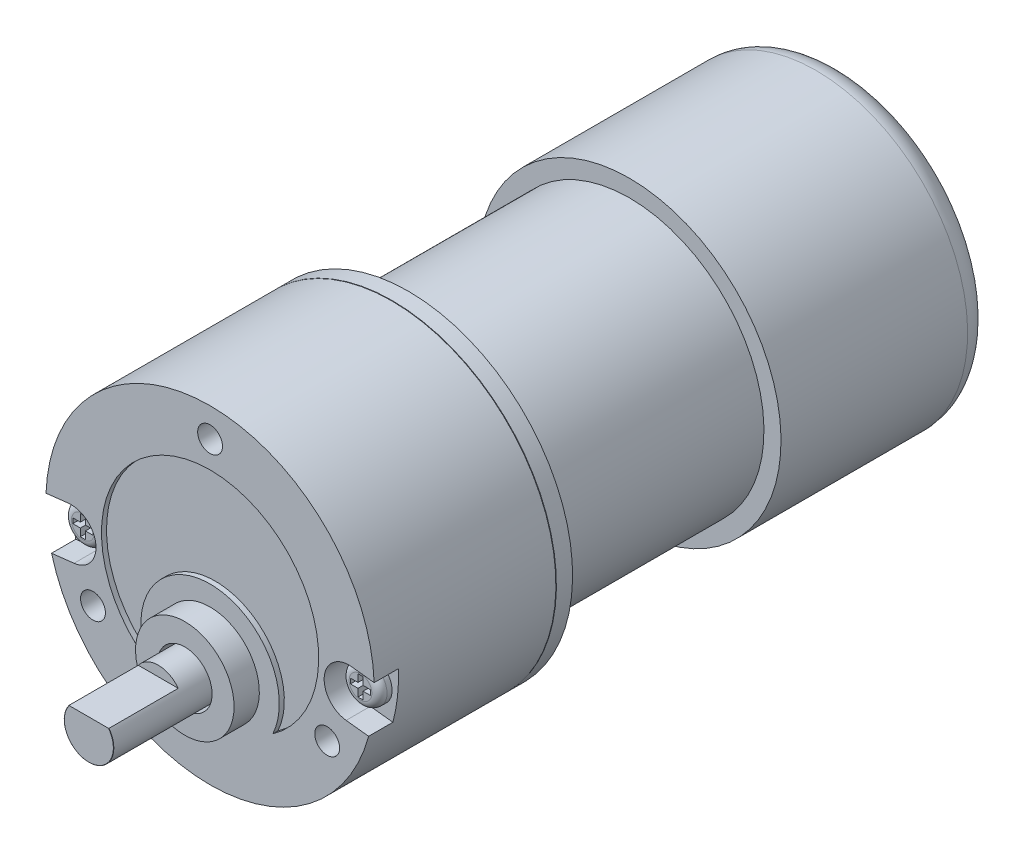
ISO-10303-21;
HEADER;
FILE_DESCRIPTION(('STEP AP214'),'2;1');
FILE_NAME('part.step','',(''),(''),'','','');
FILE_SCHEMA(('AUTOMOTIVE_DESIGN { 1 0 10303 214 1 1 1 1 }'));
ENDSEC;
DATA;
#1=APPLICATION_CONTEXT('core data for automotive mechanical design processes');
#2=APPLICATION_PROTOCOL_DEFINITION('international standard','automotive_design',2000,#1);
#3=PRODUCT_CONTEXT('',#1,'mechanical');
#4=PRODUCT('Part','Part','',(#3));
#5=PRODUCT_RELATED_PRODUCT_CATEGORY('part','',(#4));
#6=PRODUCT_DEFINITION_FORMATION('','',#4);
#7=PRODUCT_DEFINITION_CONTEXT('part definition',#1,'design');
#8=PRODUCT_DEFINITION('design','',#6,#7);
#9=PRODUCT_DEFINITION_SHAPE('','',#8);
#10=(LENGTH_UNIT() NAMED_UNIT(*) SI_UNIT(.MILLI.,.METRE.));
#11=(NAMED_UNIT(*) PLANE_ANGLE_UNIT() SI_UNIT($,.RADIAN.));
#12=(NAMED_UNIT(*) SI_UNIT($,.STERADIAN.) SOLID_ANGLE_UNIT());
#13=UNCERTAINTY_MEASURE_WITH_UNIT(LENGTH_MEASURE(1.E-05),#10,'distance_accuracy_value','');
#14=(GEOMETRIC_REPRESENTATION_CONTEXT(3) GLOBAL_UNCERTAINTY_ASSIGNED_CONTEXT((#13)) GLOBAL_UNIT_ASSIGNED_CONTEXT((#10,
#11,#12)) REPRESENTATION_CONTEXT('',''));
#15=CARTESIAN_POINT('',(0.,0.,0.));
#16=DIRECTION('',(0.,0.,1.));
#17=DIRECTION('',(1.,0.,0.));
#18=AXIS2_PLACEMENT_3D('',#15,#16,#17);
#19=CARTESIAN_POINT('',(0.,0.,-2.4384));
#20=DIRECTION('',(0.,0.,1.));
#21=DIRECTION('',(1.,0.,0.));
#22=AXIS2_PLACEMENT_3D('',#19,#20,#21);
#23=PLANE('',#22);
#24=CARTESIAN_POINT('',(0.,0.,-2.4384));
#25=DIRECTION('',(0.,0.,1.));
#26=DIRECTION('',(1.,0.,0.));
#27=AXIS2_PLACEMENT_3D('',#24,#25,#26);
#28=CIRCLE('',#27,16.51);
#29=CARTESIAN_POINT('',(-16.497588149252,0.640066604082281,-2.4384));
#30=VERTEX_POINT('',#29);
#31=CARTESIAN_POINT('',(-15.9383613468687,-4.30682453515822,-2.4384));
#32=VERTEX_POINT('',#31);
#33=EDGE_CURVE('E513',#30,#32,#28,.T.);
#34=ORIENTED_EDGE('',*,*,#33,.T.);
#35=DIRECTION('',(0.993670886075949,0.112330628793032,0.));
#36=VECTOR('',#35,1.);
#37=CARTESIAN_POINT('',(0.279613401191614,-2.47344556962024,-2.4384));
#38=LINE('',#37,#36);
#39=CARTESIAN_POINT('',(-13.6776865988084,-4.05126404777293,-2.4384));
#40=VERTEX_POINT('',#39);
#41=EDGE_CURVE('E516',#32,#40,#38,.T.);
#42=ORIENTED_EDGE('',*,*,#41,.T.);
#43=CARTESIAN_POINT('',(-13.9573,-1.57781847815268,-2.4384));
#44=DIRECTION('',(0.,0.,1.));
#45=DIRECTION('',(1.,0.,0.));
#46=AXIS2_PLACEMENT_3D('',#43,#44,#45);
#47=CIRCLE('',#46,2.4892);
#48=CARTESIAN_POINT('',(-14.2369134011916,0.895627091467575,-2.4384));
#49=VERTEX_POINT('',#48);
#50=EDGE_CURVE('E520',#40,#49,#47,.T.);
#51=ORIENTED_EDGE('',*,*,#50,.T.);
#52=DIRECTION('',(-0.993670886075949,-0.112330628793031,0.));
#53=VECTOR('',#52,1.);
#54=CARTESIAN_POINT('',(-0.279613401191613,2.47344556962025,-2.4384));
#55=LINE('',#54,#53);
#56=EDGE_CURVE('E523',#49,#30,#55,.T.);
#57=ORIENTED_EDGE('',*,*,#56,.T.);
#58=EDGE_LOOP('',(#34,#42,#51,#57));
#59=FACE_BOUND('',#58,.T.);
#60=CARTESIAN_POINT('',(-13.9573,-1.57781847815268,-2.4384));
#61=DIRECTION('',(0.,0.,1.));
#62=DIRECTION('',(1.,0.,0.));
#63=AXIS2_PLACEMENT_3D('',#60,#61,#62);
#64=CIRCLE('',#63,1.905);
#65=CARTESIAN_POINT('',(-12.0523,-1.57781847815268,-2.4384));
#66=VERTEX_POINT('',#65);
#67=EDGE_CURVE('E309',#66,#66,#64,.T.);
#68=ORIENTED_EDGE('',*,*,#67,.F.);
#69=EDGE_LOOP('',(#68));
#70=FACE_BOUND('',#69,.T.);
#71=ADVANCED_FACE('F40',(#59,#70),#23,.T.);
#72=CARTESIAN_POINT('',(0.,0.,-2.4384));
#73=DIRECTION('',(0.,0.,1.));
#74=DIRECTION('',(1.,0.,0.));
#75=AXIS2_PLACEMENT_3D('',#72,#73,#74);
#76=PLANE('',#75);
#77=DIRECTION('',(0.993670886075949,-0.112330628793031,0.));
#78=VECTOR('',#77,1.);
#79=CARTESIAN_POINT('',(0.279613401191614,2.47344556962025,-2.4384));
#80=LINE('',#79,#78);
#81=CARTESIAN_POINT('',(14.2369134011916,0.895627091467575,-2.4384));
#82=VERTEX_POINT('',#81);
#83=CARTESIAN_POINT('',(16.497588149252,0.640066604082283,-2.4384));
#84=VERTEX_POINT('',#83);
#85=EDGE_CURVE('E485',#82,#84,#80,.T.);
#86=ORIENTED_EDGE('',*,*,#85,.F.);
#87=CARTESIAN_POINT('',(13.9573,-1.57781847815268,-2.4384));
#88=DIRECTION('',(0.,0.,1.));
#89=DIRECTION('',(1.,0.,0.));
#90=AXIS2_PLACEMENT_3D('',#87,#88,#89);
#91=CIRCLE('',#90,2.4892);
#92=CARTESIAN_POINT('',(13.6776865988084,-4.05126404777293,-2.4384));
#93=VERTEX_POINT('',#92);
#94=EDGE_CURVE('E487',#82,#93,#91,.T.);
#95=ORIENTED_EDGE('',*,*,#94,.T.);
#96=DIRECTION('',(-0.993670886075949,0.112330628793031,0.));
#97=VECTOR('',#96,1.);
#98=CARTESIAN_POINT('',(-0.279613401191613,-2.47344556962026,-2.4384));
#99=LINE('',#98,#97);
#100=CARTESIAN_POINT('',(15.9383613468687,-4.30682453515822,-2.4384));
#101=VERTEX_POINT('',#100);
#102=EDGE_CURVE('E491',#101,#93,#99,.T.);
#103=ORIENTED_EDGE('',*,*,#102,.F.);
#104=CARTESIAN_POINT('',(0.,0.,-2.4384));
#105=DIRECTION('',(0.,0.,1.));
#106=DIRECTION('',(1.,0.,0.));
#107=AXIS2_PLACEMENT_3D('',#104,#105,#106);
#108=CIRCLE('',#107,16.51);
#109=EDGE_CURVE('E493',#101,#84,#108,.T.);
#110=ORIENTED_EDGE('',*,*,#109,.T.);
#111=EDGE_LOOP('',(#86,#95,#103,#110));
#112=FACE_BOUND('',#111,.T.);
#113=CARTESIAN_POINT('',(13.9573,-1.57781847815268,-2.4384));
#114=DIRECTION('',(0.,0.,1.));
#115=DIRECTION('',(1.,0.,0.));
#116=AXIS2_PLACEMENT_3D('',#113,#114,#115);
#117=CIRCLE('',#116,1.905);
#118=CARTESIAN_POINT('',(15.8623,-1.57781847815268,-2.4384));
#119=VERTEX_POINT('',#118);
#120=EDGE_CURVE('E390',#119,#119,#117,.T.);
#121=ORIENTED_EDGE('',*,*,#120,.F.);
#122=EDGE_LOOP('',(#121));
#123=FACE_BOUND('',#122,.T.);
#124=ADVANCED_FACE('F759',(#112,#123),#76,.T.);
#125=CARTESIAN_POINT('',(0.,0.,0.));
#126=DIRECTION('',(0.,0.,-1.));
#127=DIRECTION('',(0.,1.,0.));
#128=AXIS2_PLACEMENT_3D('',#125,#126,#127);
#129=PLANE('',#128);
#130=CARTESIAN_POINT('',(0.,13.5941739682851,0.));
#131=DIRECTION('',(0.,0.,1.));
#132=DIRECTION('',(1.,0.,0.));
#133=AXIS2_PLACEMENT_3D('',#130,#131,#132);
#134=CIRCLE('',#133,1.25);
#135=CARTESIAN_POINT('',(1.25,13.5941739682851,0.));
#136=VERTEX_POINT('',#135);
#137=EDGE_CURVE('E466',#136,#136,#134,.T.);
#138=ORIENTED_EDGE('',*,*,#137,.F.);
#139=EDGE_LOOP('',(#138));
#140=FACE_BOUND('',#139,.T.);
#141=CARTESIAN_POINT('',(-11.7729,-6.79708698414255,0.));
#142=DIRECTION('',(0.,0.,1.));
#143=DIRECTION('',(1.,0.,0.));
#144=AXIS2_PLACEMENT_3D('',#141,#142,#143);
#145=CIRCLE('',#144,1.25);
#146=CARTESIAN_POINT('',(-10.5229,-6.79708698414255,0.));
#147=VERTEX_POINT('',#146);
#148=EDGE_CURVE('E472',#147,#147,#145,.T.);
#149=ORIENTED_EDGE('',*,*,#148,.F.);
#150=EDGE_LOOP('',(#149));
#151=FACE_BOUND('',#150,.T.);
#152=CARTESIAN_POINT('',(11.7729,-6.79708698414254,0.));
#153=DIRECTION('',(0.,0.,1.));
#154=DIRECTION('',(1.,0.,0.));
#155=AXIS2_PLACEMENT_3D('',#152,#153,#154);
#156=CIRCLE('',#155,1.25);
#157=CARTESIAN_POINT('',(13.0229,-6.79708698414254,0.));
#158=VERTEX_POINT('',#157);
#159=EDGE_CURVE('E478',#158,#158,#156,.T.);
#160=ORIENTED_EDGE('',*,*,#159,.F.);
#161=EDGE_LOOP('',(#160));
#162=FACE_BOUND('',#161,.T.);
#163=CARTESIAN_POINT('',(0.,-5.969,0.));
#164=DIRECTION('',(0.,0.,1.));
#165=DIRECTION('',(1.,0.,0.));
#166=AXIS2_PLACEMENT_3D('',#163,#164,#165);
#167=CIRCLE('',#166,6.9596);
#168=CARTESIAN_POINT('',(6.30314068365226,-8.91966936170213,0.));
#169=VERTEX_POINT('',#168);
#170=CARTESIAN_POINT('',(-6.30314068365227,-8.91966936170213,0.));
#171=VERTEX_POINT('',#170);
#172=EDGE_CURVE('E535',#169,#171,#167,.T.);
#173=ORIENTED_EDGE('',*,*,#172,.T.);
#174=CARTESIAN_POINT('',(0.,0.,0.));
#175=DIRECTION('',(0.,0.,1.));
#176=DIRECTION('',(1.,0.,0.));
#177=AXIS2_PLACEMENT_3D('',#174,#175,#176);
#178=CIRCLE('',#177,10.922);
#179=EDGE_CURVE('E545',#169,#171,#178,.T.);
#180=ORIENTED_EDGE('',*,*,#179,.F.);
#181=EDGE_LOOP('',(#173,#180));
#182=FACE_BOUND('',#181,.T.);
#183=CARTESIAN_POINT('',(0.,-5.969,0.));
#184=DIRECTION('',(0.,0.,-1.));
#185=DIRECTION('',(0.,1.,0.));
#186=AXIS2_PLACEMENT_3D('',#183,#184,#185);
#187=CIRCLE('',#186,4.953);
#188=CARTESIAN_POINT('',(0.,-1.016,0.));
#189=VERTEX_POINT('',#188);
#190=EDGE_CURVE('E606',#189,#189,#187,.F.);
#191=ORIENTED_EDGE('',*,*,#190,.F.);
#192=EDGE_LOOP('',(#191));
#193=FACE_BOUND('',#192,.T.);
#194=DIRECTION('',(0.993670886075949,-0.112330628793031,0.));
#195=VECTOR('',#194,1.);
#196=CARTESIAN_POINT('',(0.279613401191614,2.47344556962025,0.));
#197=LINE('',#196,#195);
#198=CARTESIAN_POINT('',(14.2369134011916,0.895627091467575,0.));
#199=VERTEX_POINT('',#198);
#200=CARTESIAN_POINT('',(16.497588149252,0.640066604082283,0.));
#201=VERTEX_POINT('',#200);
#202=EDGE_CURVE('E484',#199,#201,#197,.T.);
#203=ORIENTED_EDGE('',*,*,#202,.T.);
#204=CARTESIAN_POINT('',(0.,0.,0.));
#205=DIRECTION('',(0.,0.,-1.));
#206=DIRECTION('',(0.,1.,0.));
#207=AXIS2_PLACEMENT_3D('',#204,#205,#206);
#208=CIRCLE('',#207,16.51);
#209=CARTESIAN_POINT('',(-16.497588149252,0.640066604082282,0.));
#210=VERTEX_POINT('',#209);
#211=EDGE_CURVE('E567',#210,#201,#208,.T.);
#212=ORIENTED_EDGE('',*,*,#211,.F.);
#213=DIRECTION('',(-0.993670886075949,-0.112330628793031,0.));
#214=VECTOR('',#213,1.);
#215=CARTESIAN_POINT('',(-0.279613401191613,2.47344556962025,0.));
#216=LINE('',#215,#214);
#217=CARTESIAN_POINT('',(-14.2369134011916,0.895627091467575,0.));
#218=VERTEX_POINT('',#217);
#219=EDGE_CURVE('E517',#218,#210,#216,.T.);
#220=ORIENTED_EDGE('',*,*,#219,.F.);
#221=CARTESIAN_POINT('',(-13.9573,-1.57781847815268,0.));
#222=DIRECTION('',(0.,0.,1.));
#223=DIRECTION('',(1.,0.,0.));
#224=AXIS2_PLACEMENT_3D('',#221,#222,#223);
#225=CIRCLE('',#224,2.4892);
#226=CARTESIAN_POINT('',(-13.6776865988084,-4.05126404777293,0.));
#227=VERTEX_POINT('',#226);
#228=EDGE_CURVE('E528',#227,#218,#225,.T.);
#229=ORIENTED_EDGE('',*,*,#228,.F.);
#230=DIRECTION('',(0.993670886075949,0.112330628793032,0.));
#231=VECTOR('',#230,1.);
#232=CARTESIAN_POINT('',(0.279613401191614,-2.47344556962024,0.));
#233=LINE('',#232,#231);
#234=CARTESIAN_POINT('',(-15.9383613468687,-4.30682453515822,0.));
#235=VERTEX_POINT('',#234);
#236=EDGE_CURVE('E506',#235,#227,#233,.T.);
#237=ORIENTED_EDGE('',*,*,#236,.F.);
#238=CARTESIAN_POINT('',(15.9383613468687,-4.30682453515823,0.));
#239=VERTEX_POINT('',#238);
#240=EDGE_CURVE('E564',#239,#235,#208,.T.);
#241=ORIENTED_EDGE('',*,*,#240,.F.);
#242=DIRECTION('',(-0.993670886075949,0.112330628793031,0.));
#243=VECTOR('',#242,1.);
#244=CARTESIAN_POINT('',(-0.279613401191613,-2.47344556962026,0.));
#245=LINE('',#244,#243);
#246=CARTESIAN_POINT('',(13.6776865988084,-4.05126404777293,0.));
#247=VERTEX_POINT('',#246);
#248=EDGE_CURVE('E488',#239,#247,#245,.T.);
#249=ORIENTED_EDGE('',*,*,#248,.T.);
#250=CARTESIAN_POINT('',(13.9573,-1.57781847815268,0.));
#251=DIRECTION('',(0.,0.,1.));
#252=DIRECTION('',(1.,0.,0.));
#253=AXIS2_PLACEMENT_3D('',#250,#251,#252);
#254=CIRCLE('',#253,2.4892);
#255=EDGE_CURVE('E499',#199,#247,#254,.T.);
#256=ORIENTED_EDGE('',*,*,#255,.F.);
#257=EDGE_LOOP('',(#203,#212,#220,#229,#237,#241,#249,#256));
#258=FACE_BOUND('',#257,.T.);
#259=ADVANCED_FACE('F824',(#140,#151,#162,#182,#193,#258),#129,.F.);
#260=CARTESIAN_POINT('',(0.,0.,-64.7519487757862));
#261=DIRECTION('',(0.,0.,-1.));
#262=DIRECTION('',(0.,1.,0.));
#263=AXIS2_PLACEMENT_3D('',#260,#261,#262);
#264=CYLINDRICAL_SURFACE('',#263,16.51);
#265=CARTESIAN_POINT('',(0.,0.,-18.2626));
#266=DIRECTION('',(0.,0.,-1.));
#267=DIRECTION('',(0.,1.,0.));
#268=AXIS2_PLACEMENT_3D('',#265,#266,#267);
#269=CIRCLE('',#268,16.51);
#270=CARTESIAN_POINT('',(0.,16.51,-18.2626));
#271=VERTEX_POINT('',#270);
#272=EDGE_CURVE('E570',#271,#271,#269,.T.);
#273=ORIENTED_EDGE('',*,*,#272,.F.);
#274=EDGE_LOOP('',(#273));
#275=FACE_BOUND('',#274,.T.);
#276=DIRECTION('',(0.,0.,1.));
#277=VECTOR('',#276,1.);
#278=CARTESIAN_POINT('',(16.497588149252,0.640066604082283,-2.4384));
#279=LINE('',#278,#277);
#280=EDGE_CURVE('E504',#84,#201,#279,.T.);
#281=ORIENTED_EDGE('',*,*,#280,.F.);
#282=ORIENTED_EDGE('',*,*,#109,.F.);
#283=DIRECTION('',(0.,0.,1.));
#284=VECTOR('',#283,1.);
#285=CARTESIAN_POINT('',(15.9383613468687,-4.30682453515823,-2.4384));
#286=LINE('',#285,#284);
#287=EDGE_CURVE('E507',#101,#239,#286,.T.);
#288=ORIENTED_EDGE('',*,*,#287,.T.);
#289=ORIENTED_EDGE('',*,*,#240,.T.);
#290=DIRECTION('',(0.,0.,1.));
#291=VECTOR('',#290,1.);
#292=CARTESIAN_POINT('',(-15.9383613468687,-4.30682453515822,-2.4384));
#293=LINE('',#292,#291);
#294=EDGE_CURVE('E525',#32,#235,#293,.T.);
#295=ORIENTED_EDGE('',*,*,#294,.F.);
#296=ORIENTED_EDGE('',*,*,#33,.F.);
#297=DIRECTION('',(0.,0.,1.));
#298=VECTOR('',#297,1.);
#299=CARTESIAN_POINT('',(-16.497588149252,0.640066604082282,-2.4384));
#300=LINE('',#299,#298);
#301=EDGE_CURVE('E532',#30,#210,#300,.T.);
#302=ORIENTED_EDGE('',*,*,#301,.T.);
#303=ORIENTED_EDGE('',*,*,#211,.T.);
#304=EDGE_LOOP('',(#281,#282,#288,#289,#295,#296,#302,#303));
#305=FACE_BOUND('',#304,.T.);
#306=ADVANCED_FACE('F822',(#275,#305),#264,.T.);
#307=CARTESIAN_POINT('',(0.,-5.969,0.));
#308=DIRECTION('',(0.,0.,1.));
#309=DIRECTION('',(1.,0.,0.));
#310=AXIS2_PLACEMENT_3D('',#307,#308,#309);
#311=CIRCLE('',#310,2.7432);
#312=CARTESIAN_POINT('',(2.7432,-5.969,0.));
#313=VERTEX_POINT('',#312);
#314=EDGE_CURVE('E555',#313,#313,#311,.T.);
#315=ORIENTED_EDGE('',*,*,#314,.T.);
#316=EDGE_LOOP('',(#315));
#317=FACE_BOUND('',#316,.T.);
#318=CARTESIAN_POINT('',(0.,-5.969,0.));
#319=DIRECTION('',(0.,0.,-1.));
#320=DIRECTION('',(0.,1.,0.));
#321=AXIS2_PLACEMENT_3D('',#318,#319,#320);
#322=CIRCLE('',#321,2.4892);
#323=CARTESIAN_POINT('',(0.,-3.4798,0.));
#324=VERTEX_POINT('',#323);
#325=EDGE_CURVE('E609',#324,#324,#322,.F.);
#326=ORIENTED_EDGE('',*,*,#325,.F.);
#327=EDGE_LOOP('',(#326));
#328=FACE_BOUND('',#327,.T.);
#329=ADVANCED_FACE('F818',(#317,#328),#129,.F.);
#330=CARTESIAN_POINT('',(0.,0.,-63.4819487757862));
#331=DIRECTION('',(0.,0.,-1.));
#332=DIRECTION('',(0.,1.,0.));
#333=AXIS2_PLACEMENT_3D('',#330,#331,#332);
#334=SPHERICAL_SURFACE('',#333,3.06605122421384);
#335=CARTESIAN_POINT('',(0.,0.,-65.6499743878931));
#336=DIRECTION('',(0.,0.,-1.));
#337=DIRECTION('',(0.,1.,0.));
#338=AXIS2_PLACEMENT_3D('',#335,#336,#337);
#339=CIRCLE('',#338,2.16802561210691);
#340=CARTESIAN_POINT('',(0.,2.16802561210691,-65.6499743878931));
#341=VERTEX_POINT('',#340);
#342=EDGE_CURVE('E603',#341,#341,#339,.T.);
#343=ORIENTED_EDGE('',*,*,#342,.T.);
#344=EDGE_LOOP('',(#343));
#345=FACE_BOUND('',#344,.T.);
#346=ADVANCED_FACE('F821',(#345),#334,.T.);
#347=CARTESIAN_POINT('',(0.,0.,-64.3579635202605));
#348=DIRECTION('',(0.,0.,1.));
#349=DIRECTION('',(0.,-1.,0.));
#350=AXIS2_PLACEMENT_3D('',#347,#348,#349);
#351=CONICAL_SURFACE('',#350,3.46003647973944,0.785398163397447);
#352=ORIENTED_EDGE('',*,*,#342,.F.);
#353=EDGE_LOOP('',(#352));
#354=FACE_BOUND('',#353,.T.);
#355=CARTESIAN_POINT('',(0.,0.,-64.3579635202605));
#356=DIRECTION('',(0.,0.,-1.));
#357=DIRECTION('',(0.,1.,0.));
#358=AXIS2_PLACEMENT_3D('',#355,#356,#357);
#359=CIRCLE('',#358,3.46003647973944);
#360=CARTESIAN_POINT('',(0.,3.46003647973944,-64.3579635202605));
#361=VERTEX_POINT('',#360);
#362=EDGE_CURVE('E600',#361,#361,#359,.T.);
#363=ORIENTED_EDGE('',*,*,#362,.T.);
#364=EDGE_LOOP('',(#363));
#365=FACE_BOUND('',#364,.T.);
#366=ADVANCED_FACE('F866',(#354,#365),#351,.T.);
#367=CARTESIAN_POINT('',(0.,0.,-64.4477660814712));
#368=DIRECTION('',(0.,0.,-1.));
#369=DIRECTION('',(0.,1.,0.));
#370=AXIS2_PLACEMENT_3D('',#367,#368,#369);
#371=TOROIDAL_SURFACE('',#370,3.54983904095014,0.127000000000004);
#372=ORIENTED_EDGE('',*,*,#362,.F.);
#373=EDGE_LOOP('',(#372));
#374=FACE_BOUND('',#373,.T.);
#375=CARTESIAN_POINT('',(0.,0.,-64.3212989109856));
#376=DIRECTION('',(0.,0.,-1.));
#377=DIRECTION('',(0.,1.,0.));
#378=AXIS2_PLACEMENT_3D('',#375,#376,#377);
#379=CIRCLE('',#378,3.538217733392);
#380=CARTESIAN_POINT('',(0.,-3.53821773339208,-64.3212989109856));
#381=VERTEX_POINT('',#380);
#382=EDGE_CURVE('E597',#381,#381,#379,.T.);
#383=ORIENTED_EDGE('',*,*,#382,.T.);
#384=EDGE_LOOP('',(#383));
#385=FACE_BOUND('',#384,.T.);
#386=ADVANCED_FACE('F862',(#374,#385),#371,.F.);
#387=CARTESIAN_POINT('',(0.,0.,-63.4580473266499));
#388=DIRECTION('',(0.,0.,1.));
#389=DIRECTION('',(0.,-1.,0.));
#390=AXIS2_PLACEMENT_3D('',#387,#388,#389);
#391=CONICAL_SURFACE('',#390,12.9324261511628,1.47916178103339);
#392=CARTESIAN_POINT('',(0.,0.,-63.4580473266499));
#393=DIRECTION('',(0.,0.,-1.));
#394=DIRECTION('',(0.,1.,0.));
#395=AXIS2_PLACEMENT_3D('',#392,#393,#394);
#396=CIRCLE('',#395,12.9324261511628);
#397=CARTESIAN_POINT('',(0.,-12.9324261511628,-63.4580473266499));
#398=VERTEX_POINT('',#397);
#399=EDGE_CURVE('E594',#398,#398,#396,.T.);
#400=CARTESIAN_POINT('',(0.,-3.53821773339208,-64.3212989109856));
#401=CARTESIAN_POINT('',(0.,-3.63607407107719,-64.3123067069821));
#402=CARTESIAN_POINT('',(0.,-3.7339304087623,-64.3033145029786));
#403=CARTESIAN_POINT('',(0.,-3.92964308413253,-64.2853300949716));
#404=CARTESIAN_POINT('',(0.,-4.02749942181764,-64.2763378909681));
#405=CARTESIAN_POINT('',(0.,-4.22321209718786,-64.2583534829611));
#406=CARTESIAN_POINT('',(0.,-4.32106843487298,-64.2493612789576));
#407=CARTESIAN_POINT('',(0.,-4.5167811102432,-64.2313768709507));
#408=CARTESIAN_POINT('',(0.,-4.61463744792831,-64.2223846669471));
#409=CARTESIAN_POINT('',(0.,-4.81035012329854,-64.2044002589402));
#410=CARTESIAN_POINT('',(0.,-4.90820646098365,-64.1954080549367));
#411=CARTESIAN_POINT('',(0.,-5.10391913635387,-64.1774236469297));
#412=CARTESIAN_POINT('',(0.,-5.20177547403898,-64.1684314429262));
#413=CARTESIAN_POINT('',(0.,-5.39748814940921,-64.1504470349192));
#414=CARTESIAN_POINT('',(0.,-5.49534448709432,-64.1414548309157));
#415=CARTESIAN_POINT('',(0.,-5.69105716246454,-64.1234704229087));
#416=CARTESIAN_POINT('',(0.,-5.78891350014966,-64.1144782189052));
#417=CARTESIAN_POINT('',(0.,-5.98462617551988,-64.0964938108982));
#418=CARTESIAN_POINT('',(0.,-6.08248251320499,-64.0875016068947));
#419=CARTESIAN_POINT('',(0.,-6.27819518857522,-64.0695171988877));
#420=CARTESIAN_POINT('',(0.,-6.37605152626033,-64.0605249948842));
#421=CARTESIAN_POINT('',(0.,-6.57176420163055,-64.0425405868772));
#422=CARTESIAN_POINT('',(0.,-6.66962053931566,-64.0335483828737));
#423=CARTESIAN_POINT('',(0.,-6.86533321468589,-64.0155639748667));
#424=CARTESIAN_POINT('',(0.,-6.963189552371,-64.0065717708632));
#425=CARTESIAN_POINT('',(0.,-7.15890222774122,-63.9885873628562));
#426=CARTESIAN_POINT('',(0.,-7.25675856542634,-63.9795951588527));
#427=CARTESIAN_POINT('',(0.,-7.45247124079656,-63.9616107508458));
#428=CARTESIAN_POINT('',(0.,-7.55032757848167,-63.9526185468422));
#429=CARTESIAN_POINT('',(0.,-7.74604025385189,-63.9346341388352));
#430=CARTESIAN_POINT('',(0.,-7.84389659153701,-63.9256419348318));
#431=CARTESIAN_POINT('',(0.,-8.03960926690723,-63.9076575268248));
#432=CARTESIAN_POINT('',(0.,-8.13746560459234,-63.8986653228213));
#433=CARTESIAN_POINT('',(0.,-8.33317827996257,-63.8806809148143));
#434=CARTESIAN_POINT('',(0.,-8.43103461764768,-63.8716887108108));
#435=CARTESIAN_POINT('',(0.,-8.6267472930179,-63.8537043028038));
#436=CARTESIAN_POINT('',(0.,-8.72460363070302,-63.8447120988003));
#437=CARTESIAN_POINT('',(0.,-8.92031630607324,-63.8267276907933));
#438=CARTESIAN_POINT('',(0.,-9.01817264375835,-63.8177354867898));
#439=CARTESIAN_POINT('',(0.,-9.21388531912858,-63.7997510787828));
#440=CARTESIAN_POINT('',(0.,-9.31174165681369,-63.7907588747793));
#441=CARTESIAN_POINT('',(0.,-9.50745433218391,-63.7727744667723));
#442=CARTESIAN_POINT('',(0.,-9.60531066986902,-63.7637822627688));
#443=CARTESIAN_POINT('',(0.,-9.80102334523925,-63.7457978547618));
#444=CARTESIAN_POINT('',(0.,-9.89887968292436,-63.7368056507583));
#445=CARTESIAN_POINT('',(0.,-10.0945923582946,-63.7188212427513));
#446=CARTESIAN_POINT('',(0.,-10.1924486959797,-63.7098290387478));
#447=CARTESIAN_POINT('',(0.,-10.3881613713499,-63.6918446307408));
#448=CARTESIAN_POINT('',(0.,-10.486017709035,-63.6828524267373));
#449=CARTESIAN_POINT('',(0.,-10.6817303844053,-63.6648680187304));
#450=CARTESIAN_POINT('',(0.,-10.7795867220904,-63.6558758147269));
#451=CARTESIAN_POINT('',(0.,-10.9752993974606,-63.6378914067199));
#452=CARTESIAN_POINT('',(0.,-11.0731557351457,-63.6288992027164));
#453=CARTESIAN_POINT('',(0.,-11.2688684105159,-63.6109147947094));
#454=CARTESIAN_POINT('',(0.,-11.366724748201,-63.6019225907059));
#455=CARTESIAN_POINT('',(0.,-11.5624374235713,-63.5839381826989));
#456=CARTESIAN_POINT('',(0.,-11.6602937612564,-63.5749459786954));
#457=CARTESIAN_POINT('',(0.,-11.8560064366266,-63.5569615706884));
#458=CARTESIAN_POINT('',(0.,-11.9538627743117,-63.5479693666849));
#459=CARTESIAN_POINT('',(0.,-12.1495754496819,-63.5299849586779));
#460=CARTESIAN_POINT('',(0.,-12.247431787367,-63.5209927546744));
#461=CARTESIAN_POINT('',(0.,-12.4431444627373,-63.5030083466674));
#462=CARTESIAN_POINT('',(0.,-12.5410008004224,-63.4940161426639));
#463=CARTESIAN_POINT('',(0.,-12.7367134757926,-63.4760317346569));
#464=CARTESIAN_POINT('',(0.,-12.8345698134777,-63.4670395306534));
#465=CARTESIAN_POINT('',(0.,-12.9324261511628,-63.4580473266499));
#466=B_SPLINE_CURVE_WITH_KNOTS('',3,(#400,#401,#402,#403,#404,#405,#406,#407,#408,#409,#410,
#411,#412,#413,#414,#415,#416,#417,#418,#419,#420,#421,#422,#423,#424,#425,#426,#427,#428,#429,
#430,#431,#432,#433,#434,#435,#436,#437,#438,#439,#440,#441,#442,#443,#444,#445,#446,#447,#448,
#449,#450,#451,#452,#453,#454,#455,#456,#457,#458,#459,#460,#461,#462,#463,#464,#465),
.UNSPECIFIED.,.F.,.F.,(4,2,2,2,2,2,2,2,2,2,2,2,2,2,2,2,2,2,2,2,2,2,2,2,2,2,2,2,2,2,2,2,4),(0.,
0.294805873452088,0.589611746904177,0.884417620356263,1.17922349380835,1.47402936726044,
1.76883524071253,2.06364111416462,2.3584469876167,2.65325286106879,2.94805873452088,
3.24286460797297,3.53767048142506,3.83247635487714,4.12728222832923,4.42208810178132,
4.71689397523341,5.0116998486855,5.30650572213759,5.60131159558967,5.89611746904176,
6.19092334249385,6.48572921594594,6.78053508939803,7.07534096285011,7.3701468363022,
7.66495270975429,7.95975858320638,8.25456445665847,8.54937033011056,8.84417620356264,
9.13898207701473,9.43378795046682),.UNSPECIFIED.);
#467=EDGE_CURVE('BSEAM858',#381,#398,#466,.T.);
#468=ORIENTED_EDGE('',*,*,#382,.F.);
#469=ORIENTED_EDGE('',*,*,#399,.T.);
#470=ORIENTED_EDGE('',*,*,#467,.T.);
#471=ORIENTED_EDGE('',*,*,#467,.F.);
#472=EDGE_LOOP('',(#468,#470,#469,#471));
#473=FACE_BOUND('',#472,.T.);
#474=ADVANCED_FACE('F858',(#473),#391,.T.);
#475=CARTESIAN_POINT('',(0.,0.,-60.9287039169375));
#476=DIRECTION('',(0.,0.,-1.));
#477=DIRECTION('',(0.,1.,0.));
#478=AXIS2_PLACEMENT_3D('',#475,#476,#477);
#479=TOROIDAL_SURFACE('',#478,12.7,2.53999999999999);
#480=ORIENTED_EDGE('',*,*,#399,.F.);
#481=EDGE_LOOP('',(#480));
#482=FACE_BOUND('',#481,.T.);
#483=CARTESIAN_POINT('',(0.,0.,-60.9287039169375));
#484=DIRECTION('',(0.,0.,-1.));
#485=DIRECTION('',(0.,1.,0.));
#486=AXIS2_PLACEMENT_3D('',#483,#484,#485);
#487=CIRCLE('',#486,15.24);
#488=CARTESIAN_POINT('',(0.,15.24,-60.9287039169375));
#489=VERTEX_POINT('',#488);
#490=EDGE_CURVE('E591',#489,#489,#487,.T.);
#491=ORIENTED_EDGE('',*,*,#490,.T.);
#492=EDGE_LOOP('',(#491));
#493=FACE_BOUND('',#492,.T.);
#494=ADVANCED_FACE('F854',(#482,#493),#479,.T.);
#495=CARTESIAN_POINT('',(0.,0.,-64.7519487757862));
#496=DIRECTION('',(0.,0.,-1.));
#497=DIRECTION('',(0.,1.,0.));
#498=AXIS2_PLACEMENT_3D('',#495,#496,#497);
#499=CYLINDRICAL_SURFACE('',#498,15.24);
#500=ORIENTED_EDGE('',*,*,#490,.F.);
#501=EDGE_LOOP('',(#500));
#502=FACE_BOUND('',#501,.T.);
#503=CARTESIAN_POINT('',(0.,0.,-42.164));
#504=DIRECTION('',(0.,0.,-1.));
#505=DIRECTION('',(0.,1.,0.));
#506=AXIS2_PLACEMENT_3D('',#503,#504,#505);
#507=CIRCLE('',#506,15.24);
#508=CARTESIAN_POINT('',(0.,15.24,-42.164));
#509=VERTEX_POINT('',#508);
#510=EDGE_CURVE('E588',#509,#509,#507,.T.);
#511=ORIENTED_EDGE('',*,*,#510,.T.);
#512=EDGE_LOOP('',(#511));
#513=FACE_BOUND('',#512,.T.);
#514=ADVANCED_FACE('F850',(#502,#513),#499,.T.);
#515=CARTESIAN_POINT('',(0.,0.,-42.164));
#516=DIRECTION('',(0.,0.,-1.));
#517=DIRECTION('',(0.,1.,0.));
#518=AXIS2_PLACEMENT_3D('',#515,#516,#517);
#519=PLANE('',#518);
#520=ORIENTED_EDGE('',*,*,#510,.F.);
#521=EDGE_LOOP('',(#520));
#522=FACE_BOUND('',#521,.T.);
#523=CARTESIAN_POINT('',(0.,0.,-42.164));
#524=DIRECTION('',(0.,0.,-1.));
#525=DIRECTION('',(0.,1.,0.));
#526=AXIS2_PLACEMENT_3D('',#523,#524,#525);
#527=CIRCLE('',#526,13.5255);
#528=CARTESIAN_POINT('',(0.,13.5255,-42.164));
#529=VERTEX_POINT('',#528);
#530=EDGE_CURVE('E585',#529,#529,#527,.T.);
#531=ORIENTED_EDGE('',*,*,#530,.T.);
#532=EDGE_LOOP('',(#531));
#533=FACE_BOUND('',#532,.T.);
#534=ADVANCED_FACE('F846',(#522,#533),#519,.F.);
#535=CARTESIAN_POINT('',(0.,0.,-64.7519487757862));
#536=DIRECTION('',(0.,0.,-1.));
#537=DIRECTION('',(0.,1.,0.));
#538=AXIS2_PLACEMENT_3D('',#535,#536,#537);
#539=CYLINDRICAL_SURFACE('',#538,13.5255);
#540=ORIENTED_EDGE('',*,*,#530,.F.);
#541=EDGE_LOOP('',(#540));
#542=FACE_BOUND('',#541,.T.);
#543=CARTESIAN_POINT('',(0.,0.,-19.939));
#544=DIRECTION('',(0.,0.,-1.));
#545=DIRECTION('',(0.,1.,0.));
#546=AXIS2_PLACEMENT_3D('',#543,#544,#545);
#547=CIRCLE('',#546,13.5255);
#548=CARTESIAN_POINT('',(0.,13.5255,-19.939));
#549=VERTEX_POINT('',#548);
#550=EDGE_CURVE('E582',#549,#549,#547,.T.);
#551=ORIENTED_EDGE('',*,*,#550,.T.);
#552=EDGE_LOOP('',(#551));
#553=FACE_BOUND('',#552,.T.);
#554=ADVANCED_FACE('F842',(#542,#553),#539,.T.);
#555=CARTESIAN_POINT('',(0.,0.,-19.939));
#556=DIRECTION('',(0.,0.,1.));
#557=DIRECTION('',(0.,-1.,0.));
#558=AXIS2_PLACEMENT_3D('',#555,#556,#557);
#559=PLANE('',#558);
#560=ORIENTED_EDGE('',*,*,#550,.F.);
#561=EDGE_LOOP('',(#560));
#562=FACE_BOUND('',#561,.T.);
#563=CARTESIAN_POINT('',(0.,0.,-19.939));
#564=DIRECTION('',(0.,0.,-1.));
#565=DIRECTION('',(0.,1.,0.));
#566=AXIS2_PLACEMENT_3D('',#563,#564,#565);
#567=CIRCLE('',#566,16.51);
#568=CARTESIAN_POINT('',(0.,16.51,-19.939));
#569=VERTEX_POINT('',#568);
#570=EDGE_CURVE('E579',#569,#569,#567,.T.);
#571=ORIENTED_EDGE('',*,*,#570,.T.);
#572=EDGE_LOOP('',(#571));
#573=FACE_BOUND('',#572,.T.);
#574=ADVANCED_FACE('F838',(#562,#573),#559,.F.);
#575=CARTESIAN_POINT('',(0.,0.,-64.7519487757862));
#576=DIRECTION('',(0.,0.,-1.));
#577=DIRECTION('',(0.,1.,0.));
#578=AXIS2_PLACEMENT_3D('',#575,#576,#577);
#579=CYLINDRICAL_SURFACE('',#578,16.51);
#580=ORIENTED_EDGE('',*,*,#570,.F.);
#581=EDGE_LOOP('',(#580));
#582=FACE_BOUND('',#581,.T.);
#583=CARTESIAN_POINT('',(0.,0.,-18.3134));
#584=DIRECTION('',(0.,0.,-1.));
#585=DIRECTION('',(0.,1.,0.));
#586=AXIS2_PLACEMENT_3D('',#583,#584,#585);
#587=CIRCLE('',#586,16.51);
#588=CARTESIAN_POINT('',(0.,16.51,-18.3134));
#589=VERTEX_POINT('',#588);
#590=EDGE_CURVE('E576',#589,#589,#587,.T.);
#591=ORIENTED_EDGE('',*,*,#590,.T.);
#592=EDGE_LOOP('',(#591));
#593=FACE_BOUND('',#592,.T.);
#594=ADVANCED_FACE('F834',(#582,#593),#579,.T.);
#595=CARTESIAN_POINT('',(0.,0.,-18.288));
#596=DIRECTION('',(0.,0.,-1.));
#597=DIRECTION('',(0.,1.,0.));
#598=AXIS2_PLACEMENT_3D('',#595,#596,#597);
#599=CONICAL_SURFACE('',#598,16.4846,0.78539816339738);
#600=ORIENTED_EDGE('',*,*,#590,.F.);
#601=EDGE_LOOP('',(#600));
#602=FACE_BOUND('',#601,.T.);
#603=CARTESIAN_POINT('',(0.,0.,-18.288));
#604=DIRECTION('',(0.,0.,-1.));
#605=DIRECTION('',(0.,1.,0.));
#606=AXIS2_PLACEMENT_3D('',#603,#604,#605);
#607=CIRCLE('',#606,16.4846);
#608=CARTESIAN_POINT('',(0.,16.4846,-18.288));
#609=VERTEX_POINT('',#608);
#610=EDGE_CURVE('E573',#609,#609,#607,.T.);
#611=ORIENTED_EDGE('',*,*,#610,.T.);
#612=EDGE_LOOP('',(#611));
#613=FACE_BOUND('',#612,.T.);
#614=ADVANCED_FACE('F830',(#602,#613),#599,.T.);
#615=CARTESIAN_POINT('',(0.,0.,-18.2626));
#616=DIRECTION('',(0.,0.,1.));
#617=DIRECTION('',(0.,-1.,0.));
#618=AXIS2_PLACEMENT_3D('',#615,#616,#617);
#619=CONICAL_SURFACE('',#618,16.51,0.785398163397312);
#620=ORIENTED_EDGE('',*,*,#610,.F.);
#621=EDGE_LOOP('',(#620));
#622=FACE_BOUND('',#621,.T.);
#623=ORIENTED_EDGE('',*,*,#272,.T.);
#624=EDGE_LOOP('',(#623));
#625=FACE_BOUND('',#624,.T.);
#626=ADVANCED_FACE('F816',(#622,#625),#619,.T.);
#627=CARTESIAN_POINT('',(0.,-5.969,2.54));
#628=DIRECTION('',(0.,0.,-1.));
#629=DIRECTION('',(-1.,0.,0.));
#630=AXIS2_PLACEMENT_3D('',#627,#628,#629);
#631=CYLINDRICAL_SURFACE('',#630,2.7432);
#632=CARTESIAN_POINT('',(0.,-5.969,2.54));
#633=DIRECTION('',(0.,0.,1.));
#634=DIRECTION('',(1.,0.,0.));
#635=AXIS2_PLACEMENT_3D('',#632,#633,#634);
#636=CIRCLE('',#635,2.7432);
#637=CARTESIAN_POINT('',(2.7432,-5.969,2.54));
#638=VERTEX_POINT('',#637);
#639=EDGE_CURVE('E558',#638,#638,#636,.T.);
#640=ORIENTED_EDGE('',*,*,#639,.T.);
#641=EDGE_LOOP('',(#640));
#642=FACE_BOUND('',#641,.T.);
#643=ORIENTED_EDGE('',*,*,#314,.F.);
#644=EDGE_LOOP('',(#643));
#645=FACE_BOUND('',#644,.T.);
#646=ADVANCED_FACE('F812',(#642,#645),#631,.F.);
#647=CARTESIAN_POINT('',(0.,-5.969,2.54));
#648=DIRECTION('',(0.,0.,-1.));
#649=DIRECTION('',(-1.,0.,0.));
#650=AXIS2_PLACEMENT_3D('',#647,#648,#649);
#651=CYLINDRICAL_SURFACE('',#650,4.953);
#652=CARTESIAN_POINT('',(0.,-5.969,2.54));
#653=DIRECTION('',(0.,0.,1.));
#654=DIRECTION('',(1.,0.,0.));
#655=AXIS2_PLACEMENT_3D('',#652,#653,#654);
#656=CIRCLE('',#655,4.953);
#657=CARTESIAN_POINT('',(4.953,-5.969,2.54));
#658=VERTEX_POINT('',#657);
#659=EDGE_CURVE('E561',#658,#658,#656,.T.);
#660=ORIENTED_EDGE('',*,*,#659,.F.);
#661=EDGE_LOOP('',(#660));
#662=FACE_BOUND('',#661,.T.);
#663=ORIENTED_EDGE('',*,*,#190,.T.);
#664=EDGE_LOOP('',(#663));
#665=FACE_BOUND('',#664,.T.);
#666=ADVANCED_FACE('F808',(#662,#665),#651,.T.);
#667=CARTESIAN_POINT('',(0.,0.,2.54));
#668=DIRECTION('',(0.,0.,1.));
#669=DIRECTION('',(1.,0.,0.));
#670=AXIS2_PLACEMENT_3D('',#667,#668,#669);
#671=PLANE('',#670);
#672=ORIENTED_EDGE('',*,*,#639,.F.);
#673=EDGE_LOOP('',(#672));
#674=FACE_BOUND('',#673,.T.);
#675=ORIENTED_EDGE('',*,*,#659,.T.);
#676=EDGE_LOOP('',(#675));
#677=FACE_BOUND('',#676,.T.);
#678=ADVANCED_FACE('F805',(#674,#677),#671,.T.);
#679=CARTESIAN_POINT('',(0.,-5.969,12.192));
#680=DIRECTION('',(0.,0.,-1.));
#681=DIRECTION('',(-1.,0.,0.));
#682=AXIS2_PLACEMENT_3D('',#679,#680,#681);
#683=CYLINDRICAL_SURFACE('',#682,2.4892);
#684=DIRECTION('',(0.,0.,1.));
#685=VECTOR('',#684,1.);
#686=CARTESIAN_POINT('',(2.00643923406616,-4.4958,5.207));
#687=LINE('',#686,#685);
#688=CARTESIAN_POINT('',(2.00643923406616,-4.4958,5.207));
#689=VERTEX_POINT('',#688);
#690=CARTESIAN_POINT('',(2.00643923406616,-4.4958,12.1666));
#691=VERTEX_POINT('',#690);
#692=EDGE_CURVE('E296',#689,#691,#687,.T.);
#693=ORIENTED_EDGE('',*,*,#692,.T.);
#694=CARTESIAN_POINT('',(0.,-5.969,12.1666));
#695=DIRECTION('',(0.,0.,1.));
#696=DIRECTION('',(1.,0.,0.));
#697=AXIS2_PLACEMENT_3D('',#694,#695,#696);
#698=CIRCLE('',#697,2.4892);
#699=CARTESIAN_POINT('',(-2.00643923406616,-4.4958,12.1666));
#700=VERTEX_POINT('',#699);
#701=EDGE_CURVE('E11',#691,#700,#698,.F.);
#702=ORIENTED_EDGE('',*,*,#701,.T.);
#703=DIRECTION('',(0.,0.,1.));
#704=VECTOR('',#703,1.);
#705=CARTESIAN_POINT('',(-2.00643923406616,-4.4958,5.207));
#706=LINE('',#705,#704);
#707=CARTESIAN_POINT('',(-2.00643923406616,-4.4958,5.207));
#708=VERTEX_POINT('',#707);
#709=EDGE_CURVE('E294',#708,#700,#706,.T.);
#710=ORIENTED_EDGE('',*,*,#709,.F.);
#711=CARTESIAN_POINT('',(0.,-5.969,5.207));
#712=DIRECTION('',(0.,0.,1.));
#713=DIRECTION('',(1.,0.,0.));
#714=AXIS2_PLACEMENT_3D('',#711,#712,#713);
#715=CIRCLE('',#714,2.4892);
#716=EDGE_CURVE('E287',#689,#708,#715,.T.);
#717=ORIENTED_EDGE('',*,*,#716,.F.);
#718=EDGE_LOOP('',(#693,#702,#710,#717));
#719=FACE_BOUND('',#718,.T.);
#720=ORIENTED_EDGE('',*,*,#325,.T.);
#721=EDGE_LOOP('',(#720));
#722=FACE_BOUND('',#721,.T.);
#723=ADVANCED_FACE('F298',(#719,#722),#683,.T.);
#724=CARTESIAN_POINT('',(0.,0.,12.192));
#725=DIRECTION('',(0.,0.,1.));
#726=DIRECTION('',(1.,0.,0.));
#727=AXIS2_PLACEMENT_3D('',#724,#725,#726);
#728=PLANE('',#727);
#729=DIRECTION('',(1.,0.,0.));
#730=VECTOR('',#729,1.);
#731=CARTESIAN_POINT('',(-2.00643923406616,-4.4958,12.192));
#732=LINE('',#731,#730);
#733=CARTESIAN_POINT('',(-1.9748397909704,-4.4958,12.192));
#734=VERTEX_POINT('',#733);
#735=CARTESIAN_POINT('',(1.9748397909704,-4.4958,12.192));
#736=VERTEX_POINT('',#735);
#737=EDGE_CURVE('E291',#734,#736,#732,.T.);
#738=ORIENTED_EDGE('',*,*,#737,.F.);
#739=CARTESIAN_POINT('',(0.,-5.969,12.192));
#740=DIRECTION('',(0.,0.,1.));
#741=DIRECTION('',(1.,0.,0.));
#742=AXIS2_PLACEMENT_3D('',#739,#740,#741);
#743=CIRCLE('',#742,2.4638);
#744=EDGE_CURVE('E624',#734,#736,#743,.T.);
#745=ORIENTED_EDGE('',*,*,#744,.T.);
#746=EDGE_LOOP('',(#738,#745));
#747=FACE_BOUND('',#746,.T.);
#748=ADVANCED_FACE('F798',(#747),#728,.T.);
#749=CARTESIAN_POINT('',(0.,-5.969,-0.508));
#750=DIRECTION('',(0.,0.,1.));
#751=DIRECTION('',(1.,0.,0.));
#752=AXIS2_PLACEMENT_3D('',#749,#750,#751);
#753=CYLINDRICAL_SURFACE('',#752,6.9596);
#754=ORIENTED_EDGE('',*,*,#172,.F.);
#755=DIRECTION('',(0.,0.,1.));
#756=VECTOR('',#755,1.);
#757=CARTESIAN_POINT('',(6.30314068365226,-8.91966936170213,-0.508));
#758=LINE('',#757,#756);
#759=CARTESIAN_POINT('',(6.30314068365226,-8.91966936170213,-0.508));
#760=VERTEX_POINT('',#759);
#761=EDGE_CURVE('E548',#760,#169,#758,.T.);
#762=ORIENTED_EDGE('',*,*,#761,.F.);
#763=CARTESIAN_POINT('',(0.,-5.969,-0.508));
#764=DIRECTION('',(0.,0.,1.));
#765=DIRECTION('',(1.,0.,0.));
#766=AXIS2_PLACEMENT_3D('',#763,#764,#765);
#767=CIRCLE('',#766,6.9596);
#768=CARTESIAN_POINT('',(-6.30314068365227,-8.91966936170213,-0.508));
#769=VERTEX_POINT('',#768);
#770=EDGE_CURVE('E542',#760,#769,#767,.T.);
#771=ORIENTED_EDGE('',*,*,#770,.T.);
#772=DIRECTION('',(0.,0.,1.));
#773=VECTOR('',#772,1.);
#774=CARTESIAN_POINT('',(-6.30314068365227,-8.91966936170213,-0.508));
#775=LINE('',#774,#773);
#776=EDGE_CURVE('E553',#769,#171,#775,.T.);
#777=ORIENTED_EDGE('',*,*,#776,.T.);
#778=EDGE_LOOP('',(#754,#762,#771,#777));
#779=FACE_BOUND('',#778,.T.);
#780=ADVANCED_FACE('F794',(#779),#753,.T.);
#781=CARTESIAN_POINT('',(0.,0.,-0.508));
#782=DIRECTION('',(0.,0.,1.));
#783=DIRECTION('',(1.,0.,0.));
#784=AXIS2_PLACEMENT_3D('',#781,#782,#783);
#785=CYLINDRICAL_SURFACE('',#784,10.922);
#786=ORIENTED_EDGE('',*,*,#179,.T.);
#787=ORIENTED_EDGE('',*,*,#776,.F.);
#788=CARTESIAN_POINT('',(0.,0.,-0.508));
#789=DIRECTION('',(0.,0.,1.));
#790=DIRECTION('',(1.,0.,0.));
#791=AXIS2_PLACEMENT_3D('',#788,#789,#790);
#792=CIRCLE('',#791,10.922);
#793=EDGE_CURVE('E544',#760,#769,#792,.T.);
#794=ORIENTED_EDGE('',*,*,#793,.F.);
#795=ORIENTED_EDGE('',*,*,#761,.T.);
#796=EDGE_LOOP('',(#786,#787,#794,#795));
#797=FACE_BOUND('',#796,.T.);
#798=ADVANCED_FACE('F790',(#797),#785,.F.);
#799=CARTESIAN_POINT('',(0.,0.,-0.508));
#800=DIRECTION('',(0.,0.,1.));
#801=DIRECTION('',(1.,0.,0.));
#802=AXIS2_PLACEMENT_3D('',#799,#800,#801);
#803=PLANE('',#802);
#804=ORIENTED_EDGE('',*,*,#770,.F.);
#805=ORIENTED_EDGE('',*,*,#793,.T.);
#806=EDGE_LOOP('',(#804,#805));
#807=FACE_BOUND('',#806,.T.);
#808=ADVANCED_FACE('F780',(#807),#803,.T.);
#809=CARTESIAN_POINT('',(-0.279613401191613,2.47344556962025,-2.4384));
#810=DIRECTION('',(-0.112330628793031,0.993670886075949,0.));
#811=DIRECTION('',(-0.993670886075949,-0.112330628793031,0.));
#812=AXIS2_PLACEMENT_3D('',#809,#810,#811);
#813=PLANE('',#812);
#814=ORIENTED_EDGE('',*,*,#219,.T.);
#815=ORIENTED_EDGE('',*,*,#301,.F.);
#816=ORIENTED_EDGE('',*,*,#56,.F.);
#817=DIRECTION('',(0.,0.,1.));
#818=VECTOR('',#817,1.);
#819=CARTESIAN_POINT('',(-14.2369134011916,0.895627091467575,-2.4384));
#820=LINE('',#819,#818);
#821=EDGE_CURVE('E536',#49,#218,#820,.T.);
#822=ORIENTED_EDGE('',*,*,#821,.T.);
#823=EDGE_LOOP('',(#814,#815,#816,#822));
#824=FACE_BOUND('',#823,.T.);
#825=ADVANCED_FACE('F776',(#824),#813,.F.);
#826=CARTESIAN_POINT('',(-13.9573,-1.57781847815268,-2.4384));
#827=DIRECTION('',(0.,0.,1.));
#828=DIRECTION('',(1.,0.,0.));
#829=AXIS2_PLACEMENT_3D('',#826,#827,#828);
#830=CYLINDRICAL_SURFACE('',#829,2.4892);
#831=ORIENTED_EDGE('',*,*,#228,.T.);
#832=ORIENTED_EDGE('',*,*,#821,.F.);
#833=ORIENTED_EDGE('',*,*,#50,.F.);
#834=DIRECTION('',(0.,0.,1.));
#835=VECTOR('',#834,1.);
#836=CARTESIAN_POINT('',(-13.6776865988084,-4.05126404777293,-2.4384));
#837=LINE('',#836,#835);
#838=EDGE_CURVE('E538',#40,#227,#837,.T.);
#839=ORIENTED_EDGE('',*,*,#838,.T.);
#840=EDGE_LOOP('',(#831,#832,#833,#839));
#841=FACE_BOUND('',#840,.T.);
#842=ADVANCED_FACE('F779',(#841),#830,.F.);
#843=CARTESIAN_POINT('',(0.279613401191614,-2.47344556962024,-2.4384));
#844=DIRECTION('',(0.112330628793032,-0.993670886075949,0.));
#845=DIRECTION('',(0.993670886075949,0.112330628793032,0.));
#846=AXIS2_PLACEMENT_3D('',#843,#844,#845);
#847=PLANE('',#846);
#848=ORIENTED_EDGE('',*,*,#236,.T.);
#849=ORIENTED_EDGE('',*,*,#838,.F.);
#850=ORIENTED_EDGE('',*,*,#41,.F.);
#851=ORIENTED_EDGE('',*,*,#294,.T.);
#852=EDGE_LOOP('',(#848,#849,#850,#851));
#853=FACE_BOUND('',#852,.T.);
#854=ADVANCED_FACE('F770',(#853),#847,.F.);
#855=CARTESIAN_POINT('',(0.279613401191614,2.47344556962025,-2.4384));
#856=DIRECTION('',(-0.112330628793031,-0.993670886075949,0.));
#857=DIRECTION('',(0.993670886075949,-0.112330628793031,0.));
#858=AXIS2_PLACEMENT_3D('',#855,#856,#857);
#859=PLANE('',#858);
#860=ORIENTED_EDGE('',*,*,#202,.F.);
#861=DIRECTION('',(0.,0.,1.));
#862=VECTOR('',#861,1.);
#863=CARTESIAN_POINT('',(14.2369134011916,0.895627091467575,-2.4384));
#864=LINE('',#863,#862);
#865=EDGE_CURVE('E496',#82,#199,#864,.T.);
#866=ORIENTED_EDGE('',*,*,#865,.F.);
#867=ORIENTED_EDGE('',*,*,#85,.T.);
#868=ORIENTED_EDGE('',*,*,#280,.T.);
#869=EDGE_LOOP('',(#860,#866,#867,#868));
#870=FACE_BOUND('',#869,.T.);
#871=ADVANCED_FACE('F763',(#870),#859,.T.);
#872=CARTESIAN_POINT('',(-0.279613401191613,-2.47344556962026,-2.4384));
#873=DIRECTION('',(0.112330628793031,0.993670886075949,0.));
#874=DIRECTION('',(-0.993670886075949,0.112330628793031,0.));
#875=AXIS2_PLACEMENT_3D('',#872,#873,#874);
#876=PLANE('',#875);
#877=ORIENTED_EDGE('',*,*,#248,.F.);
#878=ORIENTED_EDGE('',*,*,#287,.F.);
#879=ORIENTED_EDGE('',*,*,#102,.T.);
#880=DIRECTION('',(0.,0.,1.));
#881=VECTOR('',#880,1.);
#882=CARTESIAN_POINT('',(13.6776865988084,-4.05126404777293,-2.4384));
#883=LINE('',#882,#881);
#884=EDGE_CURVE('E510',#93,#247,#883,.T.);
#885=ORIENTED_EDGE('',*,*,#884,.T.);
#886=EDGE_LOOP('',(#877,#878,#879,#885));
#887=FACE_BOUND('',#886,.T.);
#888=ADVANCED_FACE('F760',(#887),#876,.T.);
#889=CARTESIAN_POINT('',(13.9573,-1.57781847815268,-2.4384));
#890=DIRECTION('',(0.,0.,1.));
#891=DIRECTION('',(1.,0.,0.));
#892=AXIS2_PLACEMENT_3D('',#889,#890,#891);
#893=CYLINDRICAL_SURFACE('',#892,2.4892);
#894=ORIENTED_EDGE('',*,*,#255,.T.);
#895=ORIENTED_EDGE('',*,*,#884,.F.);
#896=ORIENTED_EDGE('',*,*,#94,.F.);
#897=ORIENTED_EDGE('',*,*,#865,.T.);
#898=EDGE_LOOP('',(#894,#895,#896,#897));
#899=FACE_BOUND('',#898,.T.);
#900=ADVANCED_FACE('F754',(#899),#893,.F.);
#901=CARTESIAN_POINT('',(11.7729,-6.79708698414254,-7.62));
#902=DIRECTION('',(0.,0.,1.));
#903=DIRECTION('',(1.,0.,0.));
#904=AXIS2_PLACEMENT_3D('',#901,#902,#903);
#905=CONICAL_SURFACE('',#904,1.25,1.02974425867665);
#906=CARTESIAN_POINT('',(11.7729,-6.79708698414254,-8.37107577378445));
#907=VERTEX_POINT('',#906);
#908=VERTEX_LOOP('',#907);
#909=FACE_BOUND('',#908,.T.);
#910=CARTESIAN_POINT('',(11.7729,-6.79708698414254,-7.62));
#911=DIRECTION('',(0.,0.,1.));
#912=DIRECTION('',(1.,0.,0.));
#913=AXIS2_PLACEMENT_3D('',#910,#911,#912);
#914=CIRCLE('',#913,1.25);
#915=CARTESIAN_POINT('',(13.0229,-6.79708698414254,-7.62));
#916=VERTEX_POINT('',#915);
#917=EDGE_CURVE('E481',#916,#916,#914,.T.);
#918=ORIENTED_EDGE('',*,*,#917,.T.);
#919=EDGE_LOOP('',(#918));
#920=FACE_BOUND('',#919,.T.);
#921=ADVANCED_FACE('F750',(#909,#920),#905,.F.);
#922=CARTESIAN_POINT('',(11.7729,-6.79708698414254,0.));
#923=DIRECTION('',(0.,0.,1.));
#924=DIRECTION('',(1.,0.,0.));
#925=AXIS2_PLACEMENT_3D('',#922,#923,#924);
#926=CYLINDRICAL_SURFACE('',#925,1.25);
#927=ORIENTED_EDGE('',*,*,#917,.F.);
#928=EDGE_LOOP('',(#927));
#929=FACE_BOUND('',#928,.T.);
#930=ORIENTED_EDGE('',*,*,#159,.T.);
#931=EDGE_LOOP('',(#930));
#932=FACE_BOUND('',#931,.T.);
#933=ADVANCED_FACE('F746',(#929,#932),#926,.F.);
#934=CARTESIAN_POINT('',(-11.7729,-6.79708698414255,-7.62));
#935=DIRECTION('',(0.,0.,1.));
#936=DIRECTION('',(1.,0.,0.));
#937=AXIS2_PLACEMENT_3D('',#934,#935,#936);
#938=CONICAL_SURFACE('',#937,1.25,1.02974425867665);
#939=CARTESIAN_POINT('',(-11.7729,-6.79708698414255,-8.37107577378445));
#940=VERTEX_POINT('',#939);
#941=VERTEX_LOOP('',#940);
#942=FACE_BOUND('',#941,.T.);
#943=CARTESIAN_POINT('',(-11.7729,-6.79708698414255,-7.62));
#944=DIRECTION('',(0.,0.,1.));
#945=DIRECTION('',(1.,0.,0.));
#946=AXIS2_PLACEMENT_3D('',#943,#944,#945);
#947=CIRCLE('',#946,1.25);
#948=CARTESIAN_POINT('',(-10.5229,-6.79708698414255,-7.62));
#949=VERTEX_POINT('',#948);
#950=EDGE_CURVE('E475',#949,#949,#947,.T.);
#951=ORIENTED_EDGE('',*,*,#950,.T.);
#952=EDGE_LOOP('',(#951));
#953=FACE_BOUND('',#952,.T.);
#954=ADVANCED_FACE('F742',(#942,#953),#938,.F.);
#955=CARTESIAN_POINT('',(-11.7729,-6.79708698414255,0.));
#956=DIRECTION('',(0.,0.,1.));
#957=DIRECTION('',(1.,0.,0.));
#958=AXIS2_PLACEMENT_3D('',#955,#956,#957);
#959=CYLINDRICAL_SURFACE('',#958,1.25);
#960=ORIENTED_EDGE('',*,*,#950,.F.);
#961=EDGE_LOOP('',(#960));
#962=FACE_BOUND('',#961,.T.);
#963=ORIENTED_EDGE('',*,*,#148,.T.);
#964=EDGE_LOOP('',(#963));
#965=FACE_BOUND('',#964,.T.);
#966=ADVANCED_FACE('F738',(#962,#965),#959,.F.);
#967=CARTESIAN_POINT('',(0.,13.5941739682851,-7.62));
#968=DIRECTION('',(0.,0.,1.));
#969=DIRECTION('',(1.,0.,0.));
#970=AXIS2_PLACEMENT_3D('',#967,#968,#969);
#971=CONICAL_SURFACE('',#970,1.25,1.02974425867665);
#972=CARTESIAN_POINT('',(0.,13.5941739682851,-8.37107577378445));
#973=VERTEX_POINT('',#972);
#974=VERTEX_LOOP('',#973);
#975=FACE_BOUND('',#974,.T.);
#976=CARTESIAN_POINT('',(0.,13.5941739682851,-7.62));
#977=DIRECTION('',(0.,0.,1.));
#978=DIRECTION('',(1.,0.,0.));
#979=AXIS2_PLACEMENT_3D('',#976,#977,#978);
#980=CIRCLE('',#979,1.25);
#981=CARTESIAN_POINT('',(1.25,13.5941739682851,-7.62));
#982=VERTEX_POINT('',#981);
#983=EDGE_CURVE('E469',#982,#982,#980,.T.);
#984=ORIENTED_EDGE('',*,*,#983,.T.);
#985=EDGE_LOOP('',(#984));
#986=FACE_BOUND('',#985,.T.);
#987=ADVANCED_FACE('F734',(#975,#986),#971,.F.);
#988=CARTESIAN_POINT('',(0.,13.5941739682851,0.));
#989=DIRECTION('',(0.,0.,1.));
#990=DIRECTION('',(1.,0.,0.));
#991=AXIS2_PLACEMENT_3D('',#988,#989,#990);
#992=CYLINDRICAL_SURFACE('',#991,1.25);
#993=ORIENTED_EDGE('',*,*,#983,.F.);
#994=EDGE_LOOP('',(#993));
#995=FACE_BOUND('',#994,.T.);
#996=ORIENTED_EDGE('',*,*,#137,.T.);
#997=EDGE_LOOP('',(#996));
#998=FACE_BOUND('',#997,.T.);
#999=ADVANCED_FACE('F731',(#995,#998),#992,.F.);
#1000=CARTESIAN_POINT('',(0.,-1.32381847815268,-1.1684));
#1001=DIRECTION('',(0.,1.,0.));
#1002=DIRECTION('',(0.,0.,1.));
#1003=AXIS2_PLACEMENT_3D('',#1000,#1001,#1002);
#1004=PLANE('',#1003);
#1005=DIRECTION('',(1.,0.,0.));
#1006=VECTOR('',#1005,1.);
#1007=CARTESIAN_POINT('',(0.,-1.32381847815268,-2.4384));
#1008=LINE('',#1007,#1006);
#1009=CARTESIAN_POINT('',(14.2113,-1.32381847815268,-2.4384));
#1010=VERTEX_POINT('',#1009);
#1011=CARTESIAN_POINT('',(14.9733,-1.32381847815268,-2.4384));
#1012=VERTEX_POINT('',#1011);
#1013=EDGE_CURVE('E385',#1010,#1012,#1008,.T.);
#1014=ORIENTED_EDGE('',*,*,#1013,.T.);
#1015=DIRECTION('',(0.,0.,-1.));
#1016=VECTOR('',#1015,1.);
#1017=CARTESIAN_POINT('',(14.9733,-1.32381847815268,-1.1684));
#1018=LINE('',#1017,#1016);
#1019=CARTESIAN_POINT('',(14.9733,-1.32381847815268,-1.1684));
#1020=VERTEX_POINT('',#1019);
#1021=EDGE_CURVE('E464',#1020,#1012,#1018,.T.);
#1022=ORIENTED_EDGE('',*,*,#1021,.F.);
#1023=DIRECTION('',(1.,0.,0.));
#1024=VECTOR('',#1023,1.);
#1025=CARTESIAN_POINT('',(0.,-1.32381847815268,-1.1684));
#1026=LINE('',#1025,#1024);
#1027=CARTESIAN_POINT('',(14.2113,-1.32381847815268,-1.1684));
#1028=VERTEX_POINT('',#1027);
#1029=EDGE_CURVE('E386',#1028,#1020,#1026,.T.);
#1030=ORIENTED_EDGE('',*,*,#1029,.F.);
#1031=DIRECTION('',(0.,0.,-1.));
#1032=VECTOR('',#1031,1.);
#1033=CARTESIAN_POINT('',(14.2113,-1.32381847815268,-1.1684));
#1034=LINE('',#1033,#1032);
#1035=EDGE_CURVE('E441',#1028,#1010,#1034,.T.);
#1036=ORIENTED_EDGE('',*,*,#1035,.T.);
#1037=EDGE_LOOP('',(#1014,#1022,#1030,#1036));
#1038=FACE_BOUND('',#1037,.T.);
#1039=ADVANCED_FACE('F714',(#1038),#1004,.F.);
#1040=CARTESIAN_POINT('',(14.9733,0.,-1.1684));
#1041=DIRECTION('',(1.,0.,0.));
#1042=DIRECTION('',(0.,0.,-1.));
#1043=AXIS2_PLACEMENT_3D('',#1040,#1041,#1042);
#1044=PLANE('',#1043);
#1045=DIRECTION('',(0.,-1.,0.));
#1046=VECTOR('',#1045,1.);
#1047=CARTESIAN_POINT('',(14.9733,0.,-2.4384));
#1048=LINE('',#1047,#1046);
#1049=CARTESIAN_POINT('',(14.9733,-1.83181847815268,-2.4384));
#1050=VERTEX_POINT('',#1049);
#1051=EDGE_CURVE('E414',#1012,#1050,#1048,.T.);
#1052=ORIENTED_EDGE('',*,*,#1051,.T.);
#1053=DIRECTION('',(0.,0.,-1.));
#1054=VECTOR('',#1053,1.);
#1055=CARTESIAN_POINT('',(14.9733,-1.83181847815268,-1.1684));
#1056=LINE('',#1055,#1054);
#1057=CARTESIAN_POINT('',(14.9733,-1.83181847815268,-1.1684));
#1058=VERTEX_POINT('',#1057);
#1059=EDGE_CURVE('E462',#1058,#1050,#1056,.T.);
#1060=ORIENTED_EDGE('',*,*,#1059,.F.);
#1061=DIRECTION('',(0.,-1.,0.));
#1062=VECTOR('',#1061,1.);
#1063=CARTESIAN_POINT('',(14.9733,0.,-1.1684));
#1064=LINE('',#1063,#1062);
#1065=EDGE_CURVE('E389',#1020,#1058,#1064,.T.);
#1066=ORIENTED_EDGE('',*,*,#1065,.F.);
#1067=ORIENTED_EDGE('',*,*,#1021,.T.);
#1068=EDGE_LOOP('',(#1052,#1060,#1066,#1067));
#1069=FACE_BOUND('',#1068,.T.);
#1070=ADVANCED_FACE('F727',(#1069),#1044,.F.);
#1071=CARTESIAN_POINT('',(0.,-1.83181847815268,-1.1684));
#1072=DIRECTION('',(0.,1.,0.));
#1073=DIRECTION('',(0.,0.,1.));
#1074=AXIS2_PLACEMENT_3D('',#1071,#1072,#1073);
#1075=PLANE('',#1074);
#1076=DIRECTION('',(1.,0.,0.));
#1077=VECTOR('',#1076,1.);
#1078=CARTESIAN_POINT('',(0.,-1.83181847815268,-2.4384));
#1079=LINE('',#1078,#1077);
#1080=CARTESIAN_POINT('',(14.2113,-1.83181847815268,-2.4384));
#1081=VERTEX_POINT('',#1080);
#1082=EDGE_CURVE('E418',#1081,#1050,#1079,.T.);
#1083=ORIENTED_EDGE('',*,*,#1082,.F.);
#1084=DIRECTION('',(0.,0.,-1.));
#1085=VECTOR('',#1084,1.);
#1086=CARTESIAN_POINT('',(14.2113,-1.83181847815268,-1.1684));
#1087=LINE('',#1086,#1085);
#1088=CARTESIAN_POINT('',(14.2113,-1.83181847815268,-1.1684));
#1089=VERTEX_POINT('',#1088);
#1090=EDGE_CURVE('E460',#1089,#1081,#1087,.T.);
#1091=ORIENTED_EDGE('',*,*,#1090,.F.);
#1092=DIRECTION('',(1.,0.,0.));
#1093=VECTOR('',#1092,1.);
#1094=CARTESIAN_POINT('',(0.,-1.83181847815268,-1.1684));
#1095=LINE('',#1094,#1093);
#1096=EDGE_CURVE('E393',#1089,#1058,#1095,.T.);
#1097=ORIENTED_EDGE('',*,*,#1096,.T.);
#1098=ORIENTED_EDGE('',*,*,#1059,.T.);
#1099=EDGE_LOOP('',(#1083,#1091,#1097,#1098));
#1100=FACE_BOUND('',#1099,.T.);
#1101=ADVANCED_FACE('F722',(#1100),#1075,.T.);
#1102=CARTESIAN_POINT('',(14.2113,0.,-1.1684));
#1103=DIRECTION('',(1.,0.,0.));
#1104=DIRECTION('',(0.,0.,-1.));
#1105=AXIS2_PLACEMENT_3D('',#1102,#1103,#1104);
#1106=PLANE('',#1105);
#1107=DIRECTION('',(0.,-1.,0.));
#1108=VECTOR('',#1107,1.);
#1109=CARTESIAN_POINT('',(14.2113,0.,-2.4384));
#1110=LINE('',#1109,#1108);
#1111=CARTESIAN_POINT('',(14.2113,-2.59381847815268,-2.4384));
#1112=VERTEX_POINT('',#1111);
#1113=EDGE_CURVE('E421',#1081,#1112,#1110,.T.);
#1114=ORIENTED_EDGE('',*,*,#1113,.T.);
#1115=DIRECTION('',(0.,0.,-1.));
#1116=VECTOR('',#1115,1.);
#1117=CARTESIAN_POINT('',(14.2113,-2.59381847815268,-1.1684));
#1118=LINE('',#1117,#1116);
#1119=CARTESIAN_POINT('',(14.2113,-2.59381847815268,-1.1684));
#1120=VERTEX_POINT('',#1119);
#1121=EDGE_CURVE('E458',#1120,#1112,#1118,.T.);
#1122=ORIENTED_EDGE('',*,*,#1121,.F.);
#1123=DIRECTION('',(0.,-1.,0.));
#1124=VECTOR('',#1123,1.);
#1125=CARTESIAN_POINT('',(14.2113,0.,-1.1684));
#1126=LINE('',#1125,#1124);
#1127=EDGE_CURVE('E396',#1089,#1120,#1126,.T.);
#1128=ORIENTED_EDGE('',*,*,#1127,.F.);
#1129=ORIENTED_EDGE('',*,*,#1090,.T.);
#1130=EDGE_LOOP('',(#1114,#1122,#1128,#1129));
#1131=FACE_BOUND('',#1130,.T.);
#1132=ADVANCED_FACE('F700',(#1131),#1106,.F.);
#1133=CARTESIAN_POINT('',(0.,-2.59381847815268,-1.1684));
#1134=DIRECTION('',(0.,1.,0.));
#1135=DIRECTION('',(0.,0.,1.));
#1136=AXIS2_PLACEMENT_3D('',#1133,#1134,#1135);
#1137=PLANE('',#1136);
#1138=DIRECTION('',(1.,0.,0.));
#1139=VECTOR('',#1138,1.);
#1140=CARTESIAN_POINT('',(0.,-2.59381847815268,-2.4384));
#1141=LINE('',#1140,#1139);
#1142=CARTESIAN_POINT('',(13.7033,-2.59381847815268,-2.4384));
#1143=VERTEX_POINT('',#1142);
#1144=EDGE_CURVE('E425',#1143,#1112,#1141,.T.);
#1145=ORIENTED_EDGE('',*,*,#1144,.F.);
#1146=DIRECTION('',(0.,0.,-1.));
#1147=VECTOR('',#1146,1.);
#1148=CARTESIAN_POINT('',(13.7033,-2.59381847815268,-1.1684));
#1149=LINE('',#1148,#1147);
#1150=CARTESIAN_POINT('',(13.7033,-2.59381847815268,-1.1684));
#1151=VERTEX_POINT('',#1150);
#1152=EDGE_CURVE('E456',#1151,#1143,#1149,.T.);
#1153=ORIENTED_EDGE('',*,*,#1152,.F.);
#1154=DIRECTION('',(1.,0.,0.));
#1155=VECTOR('',#1154,1.);
#1156=CARTESIAN_POINT('',(0.,-2.59381847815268,-1.1684));
#1157=LINE('',#1156,#1155);
#1158=EDGE_CURVE('E399',#1151,#1120,#1157,.T.);
#1159=ORIENTED_EDGE('',*,*,#1158,.T.);
#1160=ORIENTED_EDGE('',*,*,#1121,.T.);
#1161=EDGE_LOOP('',(#1145,#1153,#1159,#1160));
#1162=FACE_BOUND('',#1161,.T.);
#1163=ADVANCED_FACE('F723',(#1162),#1137,.T.);
#1164=CARTESIAN_POINT('',(13.7033,0.,-1.1684));
#1165=DIRECTION('',(1.,0.,0.));
#1166=DIRECTION('',(0.,0.,-1.));
#1167=AXIS2_PLACEMENT_3D('',#1164,#1165,#1166);
#1168=PLANE('',#1167);
#1169=DIRECTION('',(0.,-1.,0.));
#1170=VECTOR('',#1169,1.);
#1171=CARTESIAN_POINT('',(13.7033,0.,-2.4384));
#1172=LINE('',#1171,#1170);
#1173=CARTESIAN_POINT('',(13.7033,-1.83181847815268,-2.4384));
#1174=VERTEX_POINT('',#1173);
#1175=EDGE_CURVE('E429',#1174,#1143,#1172,.T.);
#1176=ORIENTED_EDGE('',*,*,#1175,.F.);
#1177=DIRECTION('',(0.,0.,-1.));
#1178=VECTOR('',#1177,1.);
#1179=CARTESIAN_POINT('',(13.7033,-1.83181847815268,-1.1684));
#1180=LINE('',#1179,#1178);
#1181=CARTESIAN_POINT('',(13.7033,-1.83181847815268,-1.1684));
#1182=VERTEX_POINT('',#1181);
#1183=EDGE_CURVE('E454',#1182,#1174,#1180,.T.);
#1184=ORIENTED_EDGE('',*,*,#1183,.F.);
#1185=DIRECTION('',(0.,-1.,0.));
#1186=VECTOR('',#1185,1.);
#1187=CARTESIAN_POINT('',(13.7033,0.,-1.1684));
#1188=LINE('',#1187,#1186);
#1189=EDGE_CURVE('E403',#1182,#1151,#1188,.T.);
#1190=ORIENTED_EDGE('',*,*,#1189,.T.);
#1191=ORIENTED_EDGE('',*,*,#1152,.T.);
#1192=EDGE_LOOP('',(#1176,#1184,#1190,#1191));
#1193=FACE_BOUND('',#1192,.T.);
#1194=ADVANCED_FACE('F709',(#1193),#1168,.T.);
#1195=CARTESIAN_POINT('',(12.9413,-1.83181847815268,-2.4384));
#1196=VERTEX_POINT('',#1195);
#1197=EDGE_CURVE('E422',#1196,#1174,#1079,.T.);
#1198=ORIENTED_EDGE('',*,*,#1197,.F.);
#1199=DIRECTION('',(0.,0.,-1.));
#1200=VECTOR('',#1199,1.);
#1201=CARTESIAN_POINT('',(12.9413,-1.83181847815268,-1.1684));
#1202=LINE('',#1201,#1200);
#1203=CARTESIAN_POINT('',(12.9413,-1.83181847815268,-1.1684));
#1204=VERTEX_POINT('',#1203);
#1205=EDGE_CURVE('E452',#1204,#1196,#1202,.T.);
#1206=ORIENTED_EDGE('',*,*,#1205,.F.);
#1207=EDGE_CURVE('E397',#1204,#1182,#1095,.T.);
#1208=ORIENTED_EDGE('',*,*,#1207,.T.);
#1209=ORIENTED_EDGE('',*,*,#1183,.T.);
#1210=EDGE_LOOP('',(#1198,#1206,#1208,#1209));
#1211=FACE_BOUND('',#1210,.T.);
#1212=ADVANCED_FACE('F717',(#1211),#1075,.T.);
#1213=CARTESIAN_POINT('',(12.9413,0.,-1.1684));
#1214=DIRECTION('',(1.,0.,0.));
#1215=DIRECTION('',(0.,0.,-1.));
#1216=AXIS2_PLACEMENT_3D('',#1213,#1214,#1215);
#1217=PLANE('',#1216);
#1218=DIRECTION('',(0.,-1.,0.));
#1219=VECTOR('',#1218,1.);
#1220=CARTESIAN_POINT('',(12.9413,0.,-2.4384));
#1221=LINE('',#1220,#1219);
#1222=CARTESIAN_POINT('',(12.9413,-1.32381847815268,-2.4384));
#1223=VERTEX_POINT('',#1222);
#1224=EDGE_CURVE('E433',#1223,#1196,#1221,.T.);
#1225=ORIENTED_EDGE('',*,*,#1224,.F.);
#1226=DIRECTION('',(0.,0.,-1.));
#1227=VECTOR('',#1226,1.);
#1228=CARTESIAN_POINT('',(12.9413,-1.32381847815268,-1.1684));
#1229=LINE('',#1228,#1227);
#1230=CARTESIAN_POINT('',(12.9413,-1.32381847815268,-1.1684));
#1231=VERTEX_POINT('',#1230);
#1232=EDGE_CURVE('E450',#1231,#1223,#1229,.T.);
#1233=ORIENTED_EDGE('',*,*,#1232,.F.);
#1234=DIRECTION('',(0.,-1.,0.));
#1235=VECTOR('',#1234,1.);
#1236=CARTESIAN_POINT('',(12.9413,0.,-1.1684));
#1237=LINE('',#1236,#1235);
#1238=EDGE_CURVE('E407',#1231,#1204,#1237,.T.);
#1239=ORIENTED_EDGE('',*,*,#1238,.T.);
#1240=ORIENTED_EDGE('',*,*,#1205,.T.);
#1241=EDGE_LOOP('',(#1225,#1233,#1239,#1240));
#1242=FACE_BOUND('',#1241,.T.);
#1243=ADVANCED_FACE('F712',(#1242),#1217,.T.);
#1244=CARTESIAN_POINT('',(13.7033,-1.32381847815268,-2.4384));
#1245=VERTEX_POINT('',#1244);
#1246=EDGE_CURVE('E415',#1223,#1245,#1008,.T.);
#1247=ORIENTED_EDGE('',*,*,#1246,.T.);
#1248=DIRECTION('',(0.,0.,-1.));
#1249=VECTOR('',#1248,1.);
#1250=CARTESIAN_POINT('',(13.7033,-1.32381847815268,-1.1684));
#1251=LINE('',#1250,#1249);
#1252=CARTESIAN_POINT('',(13.7033,-1.32381847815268,-1.1684));
#1253=VERTEX_POINT('',#1252);
#1254=EDGE_CURVE('E448',#1253,#1245,#1251,.T.);
#1255=ORIENTED_EDGE('',*,*,#1254,.F.);
#1256=EDGE_CURVE('E391',#1231,#1253,#1026,.T.);
#1257=ORIENTED_EDGE('',*,*,#1256,.F.);
#1258=ORIENTED_EDGE('',*,*,#1232,.T.);
#1259=EDGE_LOOP('',(#1247,#1255,#1257,#1258));
#1260=FACE_BOUND('',#1259,.T.);
#1261=ADVANCED_FACE('F707',(#1260),#1004,.F.);
#1262=CARTESIAN_POINT('',(13.7033,-0.561818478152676,-2.4384));
#1263=VERTEX_POINT('',#1262);
#1264=EDGE_CURVE('E432',#1263,#1245,#1172,.T.);
#1265=ORIENTED_EDGE('',*,*,#1264,.F.);
#1266=DIRECTION('',(0.,0.,-1.));
#1267=VECTOR('',#1266,1.);
#1268=CARTESIAN_POINT('',(13.7033,-0.561818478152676,-1.1684));
#1269=LINE('',#1268,#1267);
#1270=CARTESIAN_POINT('',(13.7033,-0.561818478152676,-1.1684));
#1271=VERTEX_POINT('',#1270);
#1272=EDGE_CURVE('E446',#1271,#1263,#1269,.T.);
#1273=ORIENTED_EDGE('',*,*,#1272,.F.);
#1274=EDGE_CURVE('E406',#1271,#1253,#1188,.T.);
#1275=ORIENTED_EDGE('',*,*,#1274,.T.);
#1276=ORIENTED_EDGE('',*,*,#1254,.T.);
#1277=EDGE_LOOP('',(#1265,#1273,#1275,#1276));
#1278=FACE_BOUND('',#1277,.T.);
#1279=ADVANCED_FACE('F703',(#1278),#1168,.T.);
#1280=CARTESIAN_POINT('',(0.,-0.561818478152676,-1.1684));
#1281=DIRECTION('',(0.,1.,0.));
#1282=DIRECTION('',(0.,0.,1.));
#1283=AXIS2_PLACEMENT_3D('',#1280,#1281,#1282);
#1284=PLANE('',#1283);
#1285=DIRECTION('',(1.,0.,0.));
#1286=VECTOR('',#1285,1.);
#1287=CARTESIAN_POINT('',(0.,-0.561818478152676,-2.4384));
#1288=LINE('',#1287,#1286);
#1289=CARTESIAN_POINT('',(14.2113,-0.561818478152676,-2.4384));
#1290=VERTEX_POINT('',#1289);
#1291=EDGE_CURVE('E436',#1263,#1290,#1288,.T.);
#1292=ORIENTED_EDGE('',*,*,#1291,.T.);
#1293=DIRECTION('',(0.,0.,-1.));
#1294=VECTOR('',#1293,1.);
#1295=CARTESIAN_POINT('',(14.2113,-0.561818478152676,-1.1684));
#1296=LINE('',#1295,#1294);
#1297=CARTESIAN_POINT('',(14.2113,-0.561818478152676,-1.1684));
#1298=VERTEX_POINT('',#1297);
#1299=EDGE_CURVE('E444',#1298,#1290,#1296,.T.);
#1300=ORIENTED_EDGE('',*,*,#1299,.F.);
#1301=DIRECTION('',(1.,0.,0.));
#1302=VECTOR('',#1301,1.);
#1303=CARTESIAN_POINT('',(0.,-0.561818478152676,-1.1684));
#1304=LINE('',#1303,#1302);
#1305=EDGE_CURVE('E410',#1271,#1298,#1304,.T.);
#1306=ORIENTED_EDGE('',*,*,#1305,.F.);
#1307=ORIENTED_EDGE('',*,*,#1272,.T.);
#1308=EDGE_LOOP('',(#1292,#1300,#1306,#1307));
#1309=FACE_BOUND('',#1308,.T.);
#1310=ADVANCED_FACE('F698',(#1309),#1284,.F.);
#1311=EDGE_CURVE('E426',#1290,#1010,#1110,.T.);
#1312=ORIENTED_EDGE('',*,*,#1311,.T.);
#1313=ORIENTED_EDGE('',*,*,#1035,.F.);
#1314=EDGE_CURVE('E400',#1298,#1028,#1126,.T.);
#1315=ORIENTED_EDGE('',*,*,#1314,.F.);
#1316=ORIENTED_EDGE('',*,*,#1299,.T.);
#1317=EDGE_LOOP('',(#1312,#1313,#1315,#1316));
#1318=FACE_BOUND('',#1317,.T.);
#1319=ADVANCED_FACE('F694',(#1318),#1106,.F.);
#1320=CARTESIAN_POINT('',(13.9573,-1.57781847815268,-1.1684));
#1321=DIRECTION('',(0.,0.,-1.));
#1322=DIRECTION('',(-1.,0.,0.));
#1323=AXIS2_PLACEMENT_3D('',#1320,#1321,#1322);
#1324=CYLINDRICAL_SURFACE('',#1323,1.905);
#1325=CARTESIAN_POINT('',(13.9573,-1.57781847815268,-1.9304));
#1326=DIRECTION('',(0.,0.,1.));
#1327=DIRECTION('',(1.,0.,0.));
#1328=AXIS2_PLACEMENT_3D('',#1325,#1326,#1327);
#1329=CIRCLE('',#1328,1.905);
#1330=CARTESIAN_POINT('',(15.8623,-1.57781847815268,-1.9304));
#1331=VERTEX_POINT('',#1330);
#1332=EDGE_CURVE('E615',#1331,#1331,#1329,.F.);
#1333=ORIENTED_EDGE('',*,*,#1332,.T.);
#1334=EDGE_LOOP('',(#1333));
#1335=FACE_BOUND('',#1334,.T.);
#1336=ORIENTED_EDGE('',*,*,#120,.T.);
#1337=EDGE_LOOP('',(#1336));
#1338=FACE_BOUND('',#1337,.T.);
#1339=ADVANCED_FACE('F690',(#1335,#1338),#1324,.T.);
#1340=CARTESIAN_POINT('',(0.,0.,-1.1684));
#1341=DIRECTION('',(0.,0.,1.));
#1342=DIRECTION('',(1.,0.,0.));
#1343=AXIS2_PLACEMENT_3D('',#1340,#1341,#1342);
#1344=PLANE('',#1343);
#1345=CARTESIAN_POINT('',(13.9573,-1.57781847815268,-1.1684));
#1346=DIRECTION('',(0.,0.,1.));
#1347=DIRECTION('',(1.,0.,0.));
#1348=AXIS2_PLACEMENT_3D('',#1345,#1346,#1347);
#1349=CIRCLE('',#1348,1.143);
#1350=CARTESIAN_POINT('',(15.1003,-1.57781847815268,-1.1684));
#1351=VERTEX_POINT('',#1350);
#1352=EDGE_CURVE('E612',#1351,#1351,#1349,.T.);
#1353=ORIENTED_EDGE('',*,*,#1352,.T.);
#1354=EDGE_LOOP('',(#1353));
#1355=FACE_BOUND('',#1354,.T.);
#1356=ORIENTED_EDGE('',*,*,#1029,.T.);
#1357=ORIENTED_EDGE('',*,*,#1065,.T.);
#1358=ORIENTED_EDGE('',*,*,#1096,.F.);
#1359=ORIENTED_EDGE('',*,*,#1127,.T.);
#1360=ORIENTED_EDGE('',*,*,#1158,.F.);
#1361=ORIENTED_EDGE('',*,*,#1189,.F.);
#1362=ORIENTED_EDGE('',*,*,#1207,.F.);
#1363=ORIENTED_EDGE('',*,*,#1238,.F.);
#1364=ORIENTED_EDGE('',*,*,#1256,.T.);
#1365=ORIENTED_EDGE('',*,*,#1274,.F.);
#1366=ORIENTED_EDGE('',*,*,#1305,.T.);
#1367=ORIENTED_EDGE('',*,*,#1314,.T.);
#1368=EDGE_LOOP('',(#1356,#1357,#1358,#1359,#1360,#1361,#1362,#1363,#1364,#1365,#1366,#1367));
#1369=FACE_BOUND('',#1368,.T.);
#1370=ADVANCED_FACE('F686',(#1355,#1369),#1344,.T.);
#1371=ORIENTED_EDGE('',*,*,#1051,.F.);
#1372=ORIENTED_EDGE('',*,*,#1013,.F.);
#1373=ORIENTED_EDGE('',*,*,#1311,.F.);
#1374=ORIENTED_EDGE('',*,*,#1291,.F.);
#1375=ORIENTED_EDGE('',*,*,#1264,.T.);
#1376=ORIENTED_EDGE('',*,*,#1246,.F.);
#1377=ORIENTED_EDGE('',*,*,#1224,.T.);
#1378=ORIENTED_EDGE('',*,*,#1197,.T.);
#1379=ORIENTED_EDGE('',*,*,#1175,.T.);
#1380=ORIENTED_EDGE('',*,*,#1144,.T.);
#1381=ORIENTED_EDGE('',*,*,#1113,.F.);
#1382=ORIENTED_EDGE('',*,*,#1082,.T.);
#1383=EDGE_LOOP('',(#1371,#1372,#1373,#1374,#1375,#1376,#1377,#1378,#1379,#1380,#1381,#1382));
#1384=FACE_BOUND('',#1383,.T.);
#1385=ADVANCED_FACE('F689',(#1384),#76,.T.);
#1386=CARTESIAN_POINT('',(0.,-1.32381847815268,-1.1684));
#1387=DIRECTION('',(0.,1.,0.));
#1388=DIRECTION('',(0.,0.,1.));
#1389=AXIS2_PLACEMENT_3D('',#1386,#1387,#1388);
#1390=PLANE('',#1389);
#1391=DIRECTION('',(1.,0.,0.));
#1392=VECTOR('',#1391,1.);
#1393=CARTESIAN_POINT('',(0.,-1.32381847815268,-2.4384));
#1394=LINE('',#1393,#1392);
#1395=CARTESIAN_POINT('',(-13.7033,-1.32381847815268,-2.4384));
#1396=VERTEX_POINT('',#1395);
#1397=CARTESIAN_POINT('',(-12.9413,-1.32381847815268,-2.4384));
#1398=VERTEX_POINT('',#1397);
#1399=EDGE_CURVE('E301',#1396,#1398,#1394,.T.);
#1400=ORIENTED_EDGE('',*,*,#1399,.T.);
#1401=DIRECTION('',(0.,0.,-1.));
#1402=VECTOR('',#1401,1.);
#1403=CARTESIAN_POINT('',(-12.9413,-1.32381847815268,-1.1684));
#1404=LINE('',#1403,#1402);
#1405=CARTESIAN_POINT('',(-12.9413,-1.32381847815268,-1.1684));
#1406=VERTEX_POINT('',#1405);
#1407=EDGE_CURVE('E383',#1406,#1398,#1404,.T.);
#1408=ORIENTED_EDGE('',*,*,#1407,.F.);
#1409=DIRECTION('',(1.,0.,0.));
#1410=VECTOR('',#1409,1.);
#1411=CARTESIAN_POINT('',(0.,-1.32381847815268,-1.1684));
#1412=LINE('',#1411,#1410);
#1413=CARTESIAN_POINT('',(-13.7033,-1.32381847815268,-1.1684));
#1414=VERTEX_POINT('',#1413);
#1415=EDGE_CURVE('E305',#1414,#1406,#1412,.T.);
#1416=ORIENTED_EDGE('',*,*,#1415,.F.);
#1417=DIRECTION('',(0.,0.,-1.));
#1418=VECTOR('',#1417,1.);
#1419=CARTESIAN_POINT('',(-13.7033,-1.32381847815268,-1.1684));
#1420=LINE('',#1419,#1418);
#1421=EDGE_CURVE('E360',#1414,#1396,#1420,.T.);
#1422=ORIENTED_EDGE('',*,*,#1421,.T.);
#1423=EDGE_LOOP('',(#1400,#1408,#1416,#1422));
#1424=FACE_BOUND('',#1423,.T.);
#1425=ADVANCED_FACE('F669',(#1424),#1390,.F.);
#1426=CARTESIAN_POINT('',(-12.9413,0.,-1.1684));
#1427=DIRECTION('',(1.,0.,0.));
#1428=DIRECTION('',(0.,0.,-1.));
#1429=AXIS2_PLACEMENT_3D('',#1426,#1427,#1428);
#1430=PLANE('',#1429);
#1431=DIRECTION('',(0.,-1.,0.));
#1432=VECTOR('',#1431,1.);
#1433=CARTESIAN_POINT('',(-12.9413,0.,-2.4384));
#1434=LINE('',#1433,#1432);
#1435=CARTESIAN_POINT('',(-12.9413,-1.83181847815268,-2.4384));
#1436=VERTEX_POINT('',#1435);
#1437=EDGE_CURVE('E333',#1398,#1436,#1434,.T.);
#1438=ORIENTED_EDGE('',*,*,#1437,.T.);
#1439=DIRECTION('',(0.,0.,-1.));
#1440=VECTOR('',#1439,1.);
#1441=CARTESIAN_POINT('',(-12.9413,-1.83181847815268,-1.1684));
#1442=LINE('',#1441,#1440);
#1443=CARTESIAN_POINT('',(-12.9413,-1.83181847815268,-1.1684));
#1444=VERTEX_POINT('',#1443);
#1445=EDGE_CURVE('E381',#1444,#1436,#1442,.T.);
#1446=ORIENTED_EDGE('',*,*,#1445,.F.);
#1447=DIRECTION('',(0.,-1.,0.));
#1448=VECTOR('',#1447,1.);
#1449=CARTESIAN_POINT('',(-12.9413,0.,-1.1684));
#1450=LINE('',#1449,#1448);
#1451=EDGE_CURVE('E308',#1406,#1444,#1450,.T.);
#1452=ORIENTED_EDGE('',*,*,#1451,.F.);
#1453=ORIENTED_EDGE('',*,*,#1407,.T.);
#1454=EDGE_LOOP('',(#1438,#1446,#1452,#1453));
#1455=FACE_BOUND('',#1454,.T.);
#1456=ADVANCED_FACE('F682',(#1455),#1430,.F.);
#1457=CARTESIAN_POINT('',(0.,-1.83181847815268,-1.1684));
#1458=DIRECTION('',(0.,1.,0.));
#1459=DIRECTION('',(0.,0.,1.));
#1460=AXIS2_PLACEMENT_3D('',#1457,#1458,#1459);
#1461=PLANE('',#1460);
#1462=DIRECTION('',(1.,0.,0.));
#1463=VECTOR('',#1462,1.);
#1464=CARTESIAN_POINT('',(0.,-1.83181847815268,-2.4384));
#1465=LINE('',#1464,#1463);
#1466=CARTESIAN_POINT('',(-13.7033,-1.83181847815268,-2.4384));
#1467=VERTEX_POINT('',#1466);
#1468=EDGE_CURVE('E337',#1467,#1436,#1465,.T.);
#1469=ORIENTED_EDGE('',*,*,#1468,.F.);
#1470=DIRECTION('',(0.,0.,-1.));
#1471=VECTOR('',#1470,1.);
#1472=CARTESIAN_POINT('',(-13.7033,-1.83181847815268,-1.1684));
#1473=LINE('',#1472,#1471);
#1474=CARTESIAN_POINT('',(-13.7033,-1.83181847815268,-1.1684));
#1475=VERTEX_POINT('',#1474);
#1476=EDGE_CURVE('E379',#1475,#1467,#1473,.T.);
#1477=ORIENTED_EDGE('',*,*,#1476,.F.);
#1478=DIRECTION('',(1.,0.,0.));
#1479=VECTOR('',#1478,1.);
#1480=CARTESIAN_POINT('',(0.,-1.83181847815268,-1.1684));
#1481=LINE('',#1480,#1479);
#1482=EDGE_CURVE('E312',#1475,#1444,#1481,.T.);
#1483=ORIENTED_EDGE('',*,*,#1482,.T.);
#1484=ORIENTED_EDGE('',*,*,#1445,.T.);
#1485=EDGE_LOOP('',(#1469,#1477,#1483,#1484));
#1486=FACE_BOUND('',#1485,.T.);
#1487=ADVANCED_FACE('F677',(#1486),#1461,.T.);
#1488=CARTESIAN_POINT('',(-13.7033,0.,-1.1684));
#1489=DIRECTION('',(1.,0.,0.));
#1490=DIRECTION('',(0.,0.,-1.));
#1491=AXIS2_PLACEMENT_3D('',#1488,#1489,#1490);
#1492=PLANE('',#1491);
#1493=DIRECTION('',(0.,-1.,0.));
#1494=VECTOR('',#1493,1.);
#1495=CARTESIAN_POINT('',(-13.7033,0.,-2.4384));
#1496=LINE('',#1495,#1494);
#1497=CARTESIAN_POINT('',(-13.7033,-2.59381847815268,-2.4384));
#1498=VERTEX_POINT('',#1497);
#1499=EDGE_CURVE('E340',#1467,#1498,#1496,.T.);
#1500=ORIENTED_EDGE('',*,*,#1499,.T.);
#1501=DIRECTION('',(0.,0.,-1.));
#1502=VECTOR('',#1501,1.);
#1503=CARTESIAN_POINT('',(-13.7033,-2.59381847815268,-1.1684));
#1504=LINE('',#1503,#1502);
#1505=CARTESIAN_POINT('',(-13.7033,-2.59381847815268,-1.1684));
#1506=VERTEX_POINT('',#1505);
#1507=EDGE_CURVE('E377',#1506,#1498,#1504,.T.);
#1508=ORIENTED_EDGE('',*,*,#1507,.F.);
#1509=DIRECTION('',(0.,-1.,0.));
#1510=VECTOR('',#1509,1.);
#1511=CARTESIAN_POINT('',(-13.7033,0.,-1.1684));
#1512=LINE('',#1511,#1510);
#1513=EDGE_CURVE('E315',#1475,#1506,#1512,.T.);
#1514=ORIENTED_EDGE('',*,*,#1513,.F.);
#1515=ORIENTED_EDGE('',*,*,#1476,.T.);
#1516=EDGE_LOOP('',(#1500,#1508,#1514,#1515));
#1517=FACE_BOUND('',#1516,.T.);
#1518=ADVANCED_FACE('F655',(#1517),#1492,.F.);
#1519=CARTESIAN_POINT('',(0.,-2.59381847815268,-1.1684));
#1520=DIRECTION('',(0.,1.,0.));
#1521=DIRECTION('',(0.,0.,1.));
#1522=AXIS2_PLACEMENT_3D('',#1519,#1520,#1521);
#1523=PLANE('',#1522);
#1524=DIRECTION('',(1.,0.,0.));
#1525=VECTOR('',#1524,1.);
#1526=CARTESIAN_POINT('',(0.,-2.59381847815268,-2.4384));
#1527=LINE('',#1526,#1525);
#1528=CARTESIAN_POINT('',(-14.2113,-2.59381847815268,-2.4384));
#1529=VERTEX_POINT('',#1528);
#1530=EDGE_CURVE('E344',#1529,#1498,#1527,.T.);
#1531=ORIENTED_EDGE('',*,*,#1530,.F.);
#1532=DIRECTION('',(0.,0.,-1.));
#1533=VECTOR('',#1532,1.);
#1534=CARTESIAN_POINT('',(-14.2113,-2.59381847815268,-1.1684));
#1535=LINE('',#1534,#1533);
#1536=CARTESIAN_POINT('',(-14.2113,-2.59381847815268,-1.1684));
#1537=VERTEX_POINT('',#1536);
#1538=EDGE_CURVE('E375',#1537,#1529,#1535,.T.);
#1539=ORIENTED_EDGE('',*,*,#1538,.F.);
#1540=DIRECTION('',(1.,0.,0.));
#1541=VECTOR('',#1540,1.);
#1542=CARTESIAN_POINT('',(0.,-2.59381847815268,-1.1684));
#1543=LINE('',#1542,#1541);
#1544=EDGE_CURVE('E318',#1537,#1506,#1543,.T.);
#1545=ORIENTED_EDGE('',*,*,#1544,.T.);
#1546=ORIENTED_EDGE('',*,*,#1507,.T.);
#1547=EDGE_LOOP('',(#1531,#1539,#1545,#1546));
#1548=FACE_BOUND('',#1547,.T.);
#1549=ADVANCED_FACE('F678',(#1548),#1523,.T.);
#1550=CARTESIAN_POINT('',(-14.2113,0.,-1.1684));
#1551=DIRECTION('',(1.,0.,0.));
#1552=DIRECTION('',(0.,0.,-1.));
#1553=AXIS2_PLACEMENT_3D('',#1550,#1551,#1552);
#1554=PLANE('',#1553);
#1555=DIRECTION('',(0.,-1.,0.));
#1556=VECTOR('',#1555,1.);
#1557=CARTESIAN_POINT('',(-14.2113,0.,-2.4384));
#1558=LINE('',#1557,#1556);
#1559=CARTESIAN_POINT('',(-14.2113,-1.83181847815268,-2.4384));
#1560=VERTEX_POINT('',#1559);
#1561=EDGE_CURVE('E348',#1560,#1529,#1558,.T.);
#1562=ORIENTED_EDGE('',*,*,#1561,.F.);
#1563=DIRECTION('',(0.,0.,-1.));
#1564=VECTOR('',#1563,1.);
#1565=CARTESIAN_POINT('',(-14.2113,-1.83181847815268,-1.1684));
#1566=LINE('',#1565,#1564);
#1567=CARTESIAN_POINT('',(-14.2113,-1.83181847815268,-1.1684));
#1568=VERTEX_POINT('',#1567);
#1569=EDGE_CURVE('E373',#1568,#1560,#1566,.T.);
#1570=ORIENTED_EDGE('',*,*,#1569,.F.);
#1571=DIRECTION('',(0.,-1.,0.));
#1572=VECTOR('',#1571,1.);
#1573=CARTESIAN_POINT('',(-14.2113,0.,-1.1684));
#1574=LINE('',#1573,#1572);
#1575=EDGE_CURVE('E322',#1568,#1537,#1574,.T.);
#1576=ORIENTED_EDGE('',*,*,#1575,.T.);
#1577=ORIENTED_EDGE('',*,*,#1538,.T.);
#1578=EDGE_LOOP('',(#1562,#1570,#1576,#1577));
#1579=FACE_BOUND('',#1578,.T.);
#1580=ADVANCED_FACE('F664',(#1579),#1554,.T.);
#1581=CARTESIAN_POINT('',(-14.9733,-1.83181847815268,-2.4384));
#1582=VERTEX_POINT('',#1581);
#1583=EDGE_CURVE('E341',#1582,#1560,#1465,.T.);
#1584=ORIENTED_EDGE('',*,*,#1583,.F.);
#1585=DIRECTION('',(0.,0.,-1.));
#1586=VECTOR('',#1585,1.);
#1587=CARTESIAN_POINT('',(-14.9733,-1.83181847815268,-1.1684));
#1588=LINE('',#1587,#1586);
#1589=CARTESIAN_POINT('',(-14.9733,-1.83181847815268,-1.1684));
#1590=VERTEX_POINT('',#1589);
#1591=EDGE_CURVE('E371',#1590,#1582,#1588,.T.);
#1592=ORIENTED_EDGE('',*,*,#1591,.F.);
#1593=EDGE_CURVE('E316',#1590,#1568,#1481,.T.);
#1594=ORIENTED_EDGE('',*,*,#1593,.T.);
#1595=ORIENTED_EDGE('',*,*,#1569,.T.);
#1596=EDGE_LOOP('',(#1584,#1592,#1594,#1595));
#1597=FACE_BOUND('',#1596,.T.);
#1598=ADVANCED_FACE('F672',(#1597),#1461,.T.);
#1599=CARTESIAN_POINT('',(-14.9733,0.,-1.1684));
#1600=DIRECTION('',(1.,0.,0.));
#1601=DIRECTION('',(0.,0.,-1.));
#1602=AXIS2_PLACEMENT_3D('',#1599,#1600,#1601);
#1603=PLANE('',#1602);
#1604=DIRECTION('',(0.,-1.,0.));
#1605=VECTOR('',#1604,1.);
#1606=CARTESIAN_POINT('',(-14.9733,0.,-2.4384));
#1607=LINE('',#1606,#1605);
#1608=CARTESIAN_POINT('',(-14.9733,-1.32381847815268,-2.4384));
#1609=VERTEX_POINT('',#1608);
#1610=EDGE_CURVE('E352',#1609,#1582,#1607,.T.);
#1611=ORIENTED_EDGE('',*,*,#1610,.F.);
#1612=DIRECTION('',(0.,0.,-1.));
#1613=VECTOR('',#1612,1.);
#1614=CARTESIAN_POINT('',(-14.9733,-1.32381847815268,-1.1684));
#1615=LINE('',#1614,#1613);
#1616=CARTESIAN_POINT('',(-14.9733,-1.32381847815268,-1.1684));
#1617=VERTEX_POINT('',#1616);
#1618=EDGE_CURVE('E369',#1617,#1609,#1615,.T.);
#1619=ORIENTED_EDGE('',*,*,#1618,.F.);
#1620=DIRECTION('',(0.,-1.,0.));
#1621=VECTOR('',#1620,1.);
#1622=CARTESIAN_POINT('',(-14.9733,0.,-1.1684));
#1623=LINE('',#1622,#1621);
#1624=EDGE_CURVE('E326',#1617,#1590,#1623,.T.);
#1625=ORIENTED_EDGE('',*,*,#1624,.T.);
#1626=ORIENTED_EDGE('',*,*,#1591,.T.);
#1627=EDGE_LOOP('',(#1611,#1619,#1625,#1626));
#1628=FACE_BOUND('',#1627,.T.);
#1629=ADVANCED_FACE('F667',(#1628),#1603,.T.);
#1630=CARTESIAN_POINT('',(-14.2113,-1.32381847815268,-2.4384));
#1631=VERTEX_POINT('',#1630);
#1632=EDGE_CURVE('E334',#1609,#1631,#1394,.T.);
#1633=ORIENTED_EDGE('',*,*,#1632,.T.);
#1634=DIRECTION('',(0.,0.,-1.));
#1635=VECTOR('',#1634,1.);
#1636=CARTESIAN_POINT('',(-14.2113,-1.32381847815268,-1.1684));
#1637=LINE('',#1636,#1635);
#1638=CARTESIAN_POINT('',(-14.2113,-1.32381847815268,-1.1684));
#1639=VERTEX_POINT('',#1638);
#1640=EDGE_CURVE('E367',#1639,#1631,#1637,.T.);
#1641=ORIENTED_EDGE('',*,*,#1640,.F.);
#1642=EDGE_CURVE('E310',#1617,#1639,#1412,.T.);
#1643=ORIENTED_EDGE('',*,*,#1642,.F.);
#1644=ORIENTED_EDGE('',*,*,#1618,.T.);
#1645=EDGE_LOOP('',(#1633,#1641,#1643,#1644));
#1646=FACE_BOUND('',#1645,.T.);
#1647=ADVANCED_FACE('F662',(#1646),#1390,.F.);
#1648=CARTESIAN_POINT('',(-14.2113,-0.561818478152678,-2.4384));
#1649=VERTEX_POINT('',#1648);
#1650=EDGE_CURVE('E351',#1649,#1631,#1558,.T.);
#1651=ORIENTED_EDGE('',*,*,#1650,.F.);
#1652=DIRECTION('',(0.,0.,-1.));
#1653=VECTOR('',#1652,1.);
#1654=CARTESIAN_POINT('',(-14.2113,-0.561818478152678,-1.1684));
#1655=LINE('',#1654,#1653);
#1656=CARTESIAN_POINT('',(-14.2113,-0.561818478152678,-1.1684));
#1657=VERTEX_POINT('',#1656);
#1658=EDGE_CURVE('E365',#1657,#1649,#1655,.T.);
#1659=ORIENTED_EDGE('',*,*,#1658,.F.);
#1660=EDGE_CURVE('E325',#1657,#1639,#1574,.T.);
#1661=ORIENTED_EDGE('',*,*,#1660,.T.);
#1662=ORIENTED_EDGE('',*,*,#1640,.T.);
#1663=EDGE_LOOP('',(#1651,#1659,#1661,#1662));
#1664=FACE_BOUND('',#1663,.T.);
#1665=ADVANCED_FACE('F658',(#1664),#1554,.T.);
#1666=CARTESIAN_POINT('',(0.,-0.561818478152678,-1.1684));
#1667=DIRECTION('',(0.,1.,0.));
#1668=DIRECTION('',(0.,0.,1.));
#1669=AXIS2_PLACEMENT_3D('',#1666,#1667,#1668);
#1670=PLANE('',#1669);
#1671=DIRECTION('',(1.,0.,0.));
#1672=VECTOR('',#1671,1.);
#1673=CARTESIAN_POINT('',(0.,-0.561818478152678,-2.4384));
#1674=LINE('',#1673,#1672);
#1675=CARTESIAN_POINT('',(-13.7033,-0.561818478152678,-2.4384));
#1676=VERTEX_POINT('',#1675);
#1677=EDGE_CURVE('E355',#1649,#1676,#1674,.T.);
#1678=ORIENTED_EDGE('',*,*,#1677,.T.);
#1679=DIRECTION('',(0.,0.,-1.));
#1680=VECTOR('',#1679,1.);
#1681=CARTESIAN_POINT('',(-13.7033,-0.561818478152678,-1.1684));
#1682=LINE('',#1681,#1680);
#1683=CARTESIAN_POINT('',(-13.7033,-0.561818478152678,-1.1684));
#1684=VERTEX_POINT('',#1683);
#1685=EDGE_CURVE('E363',#1684,#1676,#1682,.T.);
#1686=ORIENTED_EDGE('',*,*,#1685,.F.);
#1687=DIRECTION('',(1.,0.,0.));
#1688=VECTOR('',#1687,1.);
#1689=CARTESIAN_POINT('',(0.,-0.561818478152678,-1.1684));
#1690=LINE('',#1689,#1688);
#1691=EDGE_CURVE('E329',#1657,#1684,#1690,.T.);
#1692=ORIENTED_EDGE('',*,*,#1691,.F.);
#1693=ORIENTED_EDGE('',*,*,#1658,.T.);
#1694=EDGE_LOOP('',(#1678,#1686,#1692,#1693));
#1695=FACE_BOUND('',#1694,.T.);
#1696=ADVANCED_FACE('F653',(#1695),#1670,.F.);
#1697=EDGE_CURVE('E345',#1676,#1396,#1496,.T.);
#1698=ORIENTED_EDGE('',*,*,#1697,.T.);
#1699=ORIENTED_EDGE('',*,*,#1421,.F.);
#1700=EDGE_CURVE('E319',#1684,#1414,#1512,.T.);
#1701=ORIENTED_EDGE('',*,*,#1700,.F.);
#1702=ORIENTED_EDGE('',*,*,#1685,.T.);
#1703=EDGE_LOOP('',(#1698,#1699,#1701,#1702));
#1704=FACE_BOUND('',#1703,.T.);
#1705=ADVANCED_FACE('F649',(#1704),#1492,.F.);
#1706=CARTESIAN_POINT('',(-13.9573,-1.57781847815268,-1.1684));
#1707=DIRECTION('',(0.,0.,-1.));
#1708=DIRECTION('',(-1.,0.,0.));
#1709=AXIS2_PLACEMENT_3D('',#1706,#1707,#1708);
#1710=CYLINDRICAL_SURFACE('',#1709,1.905);
#1711=CARTESIAN_POINT('',(-13.9573,-1.57781847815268,-1.9304));
#1712=DIRECTION('',(0.,0.,1.));
#1713=DIRECTION('',(1.,0.,0.));
#1714=AXIS2_PLACEMENT_3D('',#1711,#1712,#1713);
#1715=CIRCLE('',#1714,1.905);
#1716=CARTESIAN_POINT('',(-12.0523,-1.57781847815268,-1.9304));
#1717=VERTEX_POINT('',#1716);
#1718=EDGE_CURVE('E621',#1717,#1717,#1715,.F.);
#1719=ORIENTED_EDGE('',*,*,#1718,.T.);
#1720=EDGE_LOOP('',(#1719));
#1721=FACE_BOUND('',#1720,.T.);
#1722=ORIENTED_EDGE('',*,*,#67,.T.);
#1723=EDGE_LOOP('',(#1722));
#1724=FACE_BOUND('',#1723,.T.);
#1725=ADVANCED_FACE('F645',(#1721,#1724),#1710,.T.);
#1726=CARTESIAN_POINT('',(0.,0.,-1.1684));
#1727=DIRECTION('',(0.,0.,1.));
#1728=DIRECTION('',(1.,0.,0.));
#1729=AXIS2_PLACEMENT_3D('',#1726,#1727,#1728);
#1730=PLANE('',#1729);
#1731=CARTESIAN_POINT('',(-13.9573,-1.57781847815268,-1.1684));
#1732=DIRECTION('',(0.,0.,1.));
#1733=DIRECTION('',(1.,0.,0.));
#1734=AXIS2_PLACEMENT_3D('',#1731,#1732,#1733);
#1735=CIRCLE('',#1734,1.143);
#1736=CARTESIAN_POINT('',(-12.8143,-1.57781847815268,-1.1684));
#1737=VERTEX_POINT('',#1736);
#1738=EDGE_CURVE('E618',#1737,#1737,#1735,.T.);
#1739=ORIENTED_EDGE('',*,*,#1738,.T.);
#1740=EDGE_LOOP('',(#1739));
#1741=FACE_BOUND('',#1740,.T.);
#1742=ORIENTED_EDGE('',*,*,#1415,.T.);
#1743=ORIENTED_EDGE('',*,*,#1451,.T.);
#1744=ORIENTED_EDGE('',*,*,#1482,.F.);
#1745=ORIENTED_EDGE('',*,*,#1513,.T.);
#1746=ORIENTED_EDGE('',*,*,#1544,.F.);
#1747=ORIENTED_EDGE('',*,*,#1575,.F.);
#1748=ORIENTED_EDGE('',*,*,#1593,.F.);
#1749=ORIENTED_EDGE('',*,*,#1624,.F.);
#1750=ORIENTED_EDGE('',*,*,#1642,.T.);
#1751=ORIENTED_EDGE('',*,*,#1660,.F.);
#1752=ORIENTED_EDGE('',*,*,#1691,.T.);
#1753=ORIENTED_EDGE('',*,*,#1700,.T.);
#1754=EDGE_LOOP('',(#1742,#1743,#1744,#1745,#1746,#1747,#1748,#1749,#1750,#1751,#1752,#1753));
#1755=FACE_BOUND('',#1754,.T.);
#1756=ADVANCED_FACE('F640',(#1741,#1755),#1730,.T.);
#1757=ORIENTED_EDGE('',*,*,#1437,.F.);
#1758=ORIENTED_EDGE('',*,*,#1399,.F.);
#1759=ORIENTED_EDGE('',*,*,#1697,.F.);
#1760=ORIENTED_EDGE('',*,*,#1677,.F.);
#1761=ORIENTED_EDGE('',*,*,#1650,.T.);
#1762=ORIENTED_EDGE('',*,*,#1632,.F.);
#1763=ORIENTED_EDGE('',*,*,#1610,.T.);
#1764=ORIENTED_EDGE('',*,*,#1583,.T.);
#1765=ORIENTED_EDGE('',*,*,#1561,.T.);
#1766=ORIENTED_EDGE('',*,*,#1530,.T.);
#1767=ORIENTED_EDGE('',*,*,#1499,.F.);
#1768=ORIENTED_EDGE('',*,*,#1468,.T.);
#1769=EDGE_LOOP('',(#1757,#1758,#1759,#1760,#1761,#1762,#1763,#1764,#1765,#1766,#1767,#1768));
#1770=FACE_BOUND('',#1769,.T.);
#1771=ADVANCED_FACE('F644',(#1770),#23,.T.);
#1772=CARTESIAN_POINT('',(13.9573,-1.57781847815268,-1.9304));
#1773=DIRECTION('',(0.,0.,1.));
#1774=DIRECTION('',(1.,0.,0.));
#1775=AXIS2_PLACEMENT_3D('',#1772,#1773,#1774);
#1776=TOROIDAL_SURFACE('',#1775,1.143,0.762);
#1777=ORIENTED_EDGE('',*,*,#1332,.F.);
#1778=EDGE_LOOP('',(#1777));
#1779=FACE_BOUND('',#1778,.T.);
#1780=ORIENTED_EDGE('',*,*,#1352,.F.);
#1781=EDGE_LOOP('',(#1780));
#1782=FACE_BOUND('',#1781,.T.);
#1783=ADVANCED_FACE('F774',(#1779,#1782),#1776,.T.);
#1784=CARTESIAN_POINT('',(-13.9573,-1.57781847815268,-1.9304));
#1785=DIRECTION('',(0.,0.,1.));
#1786=DIRECTION('',(1.,0.,0.));
#1787=AXIS2_PLACEMENT_3D('',#1784,#1785,#1786);
#1788=TOROIDAL_SURFACE('',#1787,1.143,0.762);
#1789=ORIENTED_EDGE('',*,*,#1718,.F.);
#1790=EDGE_LOOP('',(#1789));
#1791=FACE_BOUND('',#1790,.T.);
#1792=ORIENTED_EDGE('',*,*,#1738,.F.);
#1793=EDGE_LOOP('',(#1792));
#1794=FACE_BOUND('',#1793,.T.);
#1795=ADVANCED_FACE('F639',(#1791,#1794),#1788,.T.);
#1796=CARTESIAN_POINT('',(-2.00643923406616,-4.4958,5.207));
#1797=DIRECTION('',(0.,-1.,0.));
#1798=DIRECTION('',(0.,0.,-1.));
#1799=AXIS2_PLACEMENT_3D('',#1796,#1797,#1798);
#1800=PLANE('',#1799);
#1801=ORIENTED_EDGE('',*,*,#737,.T.);
#1802=CARTESIAN_POINT('',(1.9748397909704,-4.4958,12.192));
#1803=CARTESIAN_POINT('',(1.97698742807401,-4.4958,12.1919993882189));
#1804=CARTESIAN_POINT('',(1.97913901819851,-4.4958,12.1918247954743));
#1805=CARTESIAN_POINT('',(1.98339538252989,-4.4958,12.1911180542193));
#1806=CARTESIAN_POINT('',(1.98549979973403,-4.4958,12.1905837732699));
#1807=CARTESIAN_POINT('',(1.98923836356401,-4.4958,12.1892680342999));
#1808=CARTESIAN_POINT('',(1.99089227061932,-4.4958,12.1885429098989));
#1809=CARTESIAN_POINT('',(1.99405739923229,-4.4958,12.1868338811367));
#1810=CARTESIAN_POINT('',(1.99556899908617,-4.4958,12.1858506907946));
#1811=CARTESIAN_POINT('',(1.99812293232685,-4.4958,12.1838360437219));
#1812=CARTESIAN_POINT('',(1.99919999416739,-4.4958,12.1828486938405));
#1813=CARTESIAN_POINT('',(2.00117968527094,-4.4958,12.1807099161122));
#1814=CARTESIAN_POINT('',(2.0020822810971,-4.4958,12.1795584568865));
#1815=CARTESIAN_POINT('',(2.00367259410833,-4.4958,12.1770991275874));
#1816=CARTESIAN_POINT('',(2.00435826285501,-4.4958,12.1757899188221));
#1817=CARTESIAN_POINT('',(2.00545388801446,-4.4958,12.1730618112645));
#1818=CARTESIAN_POINT('',(2.00586456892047,-4.4958,12.171643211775));
#1819=CARTESIAN_POINT('',(2.0062268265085,-4.4958,12.1696053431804));
#1820=CARTESIAN_POINT('',(2.00630635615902,-4.4958,12.1690068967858));
#1821=CARTESIAN_POINT('',(2.00641254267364,-4.4958,12.1678057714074));
#1822=CARTESIAN_POINT('',(2.00643923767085,-4.4958,12.1672030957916));
#1823=CARTESIAN_POINT('',(2.00643923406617,-4.4958,12.1666));
#1824=B_SPLINE_CURVE_WITH_KNOTS('',3,(#1802,#1803,#1804,#1805,#1806,#1807,#1808,#1809,#1810,
#1811,#1812,#1813,#1814,#1815,#1816,#1817,#1818,#1819,#1820,#1821,#1822,#1823),.UNSPECIFIED.,
.F.,.F.,(4,2,2,2,2,2,2,2,2,2,4),(0.,0.00644269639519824,0.0129239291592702,0.0183204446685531,
0.0237021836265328,0.028068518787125,0.0324356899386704,0.0368429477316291,0.0412385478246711,
0.0430477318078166,0.0448556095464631),.UNSPECIFIED.);
#1825=EDGE_CURVE('E49',#736,#691,#1824,.T.);
#1826=ORIENTED_EDGE('',*,*,#1825,.T.);
#1827=ORIENTED_EDGE('',*,*,#692,.F.);
#1828=DIRECTION('',(1.,0.,0.));
#1829=VECTOR('',#1828,1.);
#1830=CARTESIAN_POINT('',(-2.00643923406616,-4.4958,5.207));
#1831=LINE('',#1830,#1829);
#1832=EDGE_CURVE('E290',#708,#689,#1831,.T.);
#1833=ORIENTED_EDGE('',*,*,#1832,.F.);
#1834=ORIENTED_EDGE('',*,*,#709,.T.);
#1835=CARTESIAN_POINT('',(-2.00643923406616,-4.4958,12.1666));
#1836=CARTESIAN_POINT('',(-2.00644146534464,-4.4958,12.1678330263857));
#1837=CARTESIAN_POINT('',(-2.00632800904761,-4.4958,12.1690641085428));
#1838=CARTESIAN_POINT('',(-2.00588826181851,-4.4958,12.1714806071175));
#1839=CARTESIAN_POINT('',(-2.00556320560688,-4.4958,12.1726662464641));
#1840=CARTESIAN_POINT('',(-2.00471904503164,-4.4958,12.1749634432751));
#1841=CARTESIAN_POINT('',(-2.0042002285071,-4.4958,12.1760751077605));
#1842=CARTESIAN_POINT('',(-2.00299497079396,-4.4958,12.1782043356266));
#1843=CARTESIAN_POINT('',(-2.00230832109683,-4.4958,12.1792217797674));
#1844=CARTESIAN_POINT('',(-2.00074386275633,-4.4958,12.1812125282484));
#1845=CARTESIAN_POINT('',(-1.99985617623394,-4.4958,12.1821780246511));
#1846=CARTESIAN_POINT('',(-1.99795447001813,-4.4958,12.1839742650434));
#1847=CARTESIAN_POINT('',(-1.99694041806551,-4.4958,12.1848049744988));
#1848=CARTESIAN_POINT('',(-1.99461759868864,-4.4958,12.1864695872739));
#1849=CARTESIAN_POINT('',(-1.99328898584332,-4.4958,12.1872757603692));
#1850=CARTESIAN_POINT('',(-1.9905323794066,-4.4958,12.1886961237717));
#1851=CARTESIAN_POINT('',(-1.98910428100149,-4.4958,12.1893101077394));
#1852=CARTESIAN_POINT('',(-1.98589258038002,-4.4958,12.1904512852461));
#1853=CARTESIAN_POINT('',(-1.98409441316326,-4.4958,12.1909374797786));
#1854=CARTESIAN_POINT('',(-1.9804489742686,-4.4958,12.1916437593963));
#1855=CARTESIAN_POINT('',(-1.97860176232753,-4.4958,12.1918641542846));
#1856=CARTESIAN_POINT('',(-1.97611331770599,-4.4958,12.1919846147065));
#1857=CARTESIAN_POINT('',(-1.97547642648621,-4.4958,12.1919999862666));
#1858=CARTESIAN_POINT('',(-1.9748397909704,-4.4958,12.192));
#1859=B_SPLINE_CURVE_WITH_KNOTS('',3,(#1835,#1836,#1837,#1838,#1839,#1840,#1841,#1842,#1843,
#1844,#1845,#1846,#1847,#1848,#1849,#1850,#1851,#1852,#1853,#1854,#1855,#1856,#1857,#1858),
.UNSPECIFIED.,.F.,.F.,(4,2,2,2,2,2,2,2,2,2,2,4),(0.,0.0036908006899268,0.00736025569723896,
0.0110242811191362,0.0146928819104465,0.0186129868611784,0.0225340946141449,0.0271791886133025,
0.0318292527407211,0.037396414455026,0.0429570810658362,0.0448674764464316),.UNSPECIFIED.);
#1860=EDGE_CURVE('E627',#700,#734,#1859,.T.);
#1861=ORIENTED_EDGE('',*,*,#1860,.T.);
#1862=EDGE_LOOP('',(#1801,#1826,#1827,#1833,#1834,#1861));
#1863=FACE_BOUND('',#1862,.T.);
#1864=ADVANCED_FACE('F293',(#1863),#1800,.F.);
#1865=CARTESIAN_POINT('',(0.,-5.969,5.207));
#1866=DIRECTION('',(0.,0.,1.));
#1867=DIRECTION('',(1.,0.,0.));
#1868=AXIS2_PLACEMENT_3D('',#1865,#1866,#1867);
#1869=PLANE('',#1868);
#1870=ORIENTED_EDGE('',*,*,#716,.T.);
#1871=ORIENTED_EDGE('',*,*,#1832,.T.);
#1872=EDGE_LOOP('',(#1870,#1871));
#1873=FACE_BOUND('',#1872,.T.);
#1874=ADVANCED_FACE('F289',(#1873),#1869,.T.);
#1875=CARTESIAN_POINT('',(0.,-5.969,12.1666));
#1876=DIRECTION('',(0.,0.,1.));
#1877=DIRECTION('',(1.,0.,0.));
#1878=AXIS2_PLACEMENT_3D('',#1875,#1876,#1877);
#1879=TOROIDAL_SURFACE('',#1878,2.4638,0.0254);
#1880=ORIENTED_EDGE('',*,*,#1860,.F.);
#1881=ORIENTED_EDGE('',*,*,#701,.F.);
#1882=ORIENTED_EDGE('',*,*,#1825,.F.);
#1883=ORIENTED_EDGE('',*,*,#744,.F.);
#1884=EDGE_LOOP('',(#1880,#1881,#1882,#1883));
#1885=FACE_BOUND('',#1884,.T.);
#1886=ADVANCED_FACE('F42',(#1885),#1879,.T.);
#1887=CLOSED_SHELL('',(#71,#124,#259,#306,#329,#346,#366,#386,#474,#494,#514,#534,#554,#574,
#594,#614,#626,#646,#666,#678,#723,#748,#780,#798,#808,#825,#842,#854,#871,#888,#900,#921,#933,
#954,#966,#987,#999,#1039,#1070,#1101,#1132,#1163,#1194,#1212,#1243,#1261,#1279,#1310,#1319,
#1339,#1370,#1385,#1425,#1456,#1487,#1518,#1549,#1580,#1598,#1629,#1647,#1665,#1696,#1705,#1725,
#1756,#1771,#1783,#1795,#1864,#1874,#1886));
#1888=MANIFOLD_SOLID_BREP('B2',#1887);
#1889=ADVANCED_BREP_SHAPE_REPRESENTATION('',(#18,#1888),#14);
#1890=SHAPE_DEFINITION_REPRESENTATION(#9,#1889);
ENDSEC;
END-ISO-10303-21;
